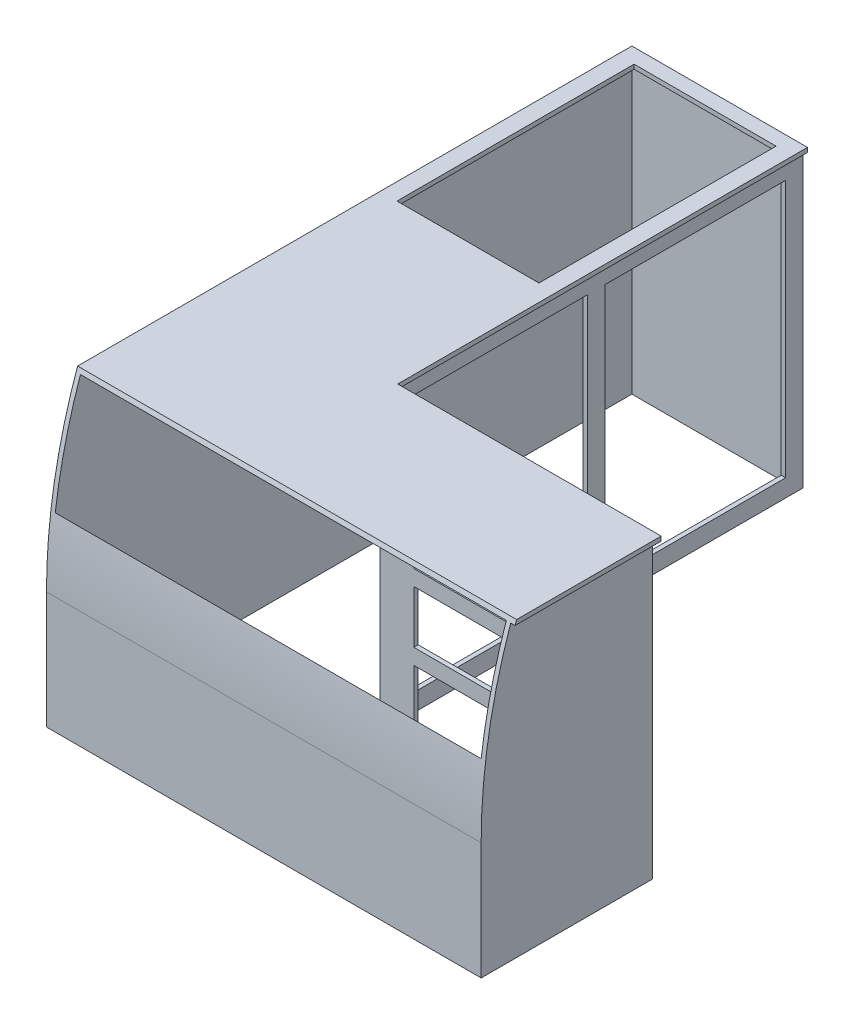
ISO-10303-21;
HEADER;
FILE_DESCRIPTION(('STEP AP214'),'2;1');
FILE_NAME('part.step','',(''),(''),'','','');
FILE_SCHEMA(('AUTOMOTIVE_DESIGN { 1 0 10303 214 1 1 1 1 }'));
ENDSEC;
DATA;
#1=APPLICATION_CONTEXT('core data for automotive mechanical design processes');
#2=APPLICATION_PROTOCOL_DEFINITION('international standard','automotive_design',2000,#1);
#3=PRODUCT_CONTEXT('',#1,'mechanical');
#4=PRODUCT('Part','Part','',(#3));
#5=PRODUCT_RELATED_PRODUCT_CATEGORY('part','',(#4));
#6=PRODUCT_DEFINITION_FORMATION('','',#4);
#7=PRODUCT_DEFINITION_CONTEXT('part definition',#1,'design');
#8=PRODUCT_DEFINITION('design','',#6,#7);
#9=PRODUCT_DEFINITION_SHAPE('','',#8);
#10=(LENGTH_UNIT() NAMED_UNIT(*) SI_UNIT(.MILLI.,.METRE.));
#11=(NAMED_UNIT(*) PLANE_ANGLE_UNIT() SI_UNIT($,.RADIAN.));
#12=(NAMED_UNIT(*) SI_UNIT($,.STERADIAN.) SOLID_ANGLE_UNIT());
#13=UNCERTAINTY_MEASURE_WITH_UNIT(LENGTH_MEASURE(1.E-05),#10,'distance_accuracy_value','');
#14=(GEOMETRIC_REPRESENTATION_CONTEXT(3) GLOBAL_UNCERTAINTY_ASSIGNED_CONTEXT((#13)) GLOBAL_UNIT_ASSIGNED_CONTEXT((#10,
#11,#12)) REPRESENTATION_CONTEXT('',''));
#15=CARTESIAN_POINT('',(0.,0.,0.));
#16=DIRECTION('',(0.,0.,1.));
#17=DIRECTION('',(1.,0.,0.));
#18=AXIS2_PLACEMENT_3D('',#15,#16,#17);
#19=CARTESIAN_POINT('',(-406.153119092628,-1015.,-766.568998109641));
#20=DIRECTION('',(0.,0.,1.));
#21=DIRECTION('',(1.,0.,0.));
#22=AXIS2_PLACEMENT_3D('',#19,#20,#21);
#23=PLANE('',#22);
#24=DIRECTION('',(0.,-1.,0.));
#25=VECTOR('',#24,1.);
#26=CARTESIAN_POINT('',(-306.153119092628,0.,-766.568998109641));
#27=LINE('',#26,#25);
#28=CARTESIAN_POINT('',(-306.153119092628,-541.7,-766.568998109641));
#29=VERTEX_POINT('',#28);
#30=CARTESIAN_POINT('',(-306.153119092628,-721.7,-766.568998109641));
#31=VERTEX_POINT('',#30);
#32=EDGE_CURVE('E405',#29,#31,#27,.T.);
#33=ORIENTED_EDGE('',*,*,#32,.T.);
#34=DIRECTION('',(-1.,0.,0.));
#35=VECTOR('',#34,1.);
#36=CARTESIAN_POINT('',(0.,-721.7,-766.568998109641));
#37=LINE('',#36,#35);
#38=CARTESIAN_POINT('',(393.846880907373,-721.7,-766.568998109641));
#39=VERTEX_POINT('',#38);
#40=EDGE_CURVE('E420',#39,#31,#37,.T.);
#41=ORIENTED_EDGE('',*,*,#40,.F.);
#42=DIRECTION('',(0.,-1.,0.));
#43=VECTOR('',#42,1.);
#44=CARTESIAN_POINT('',(393.846880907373,0.,-766.568998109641));
#45=LINE('',#44,#43);
#46=CARTESIAN_POINT('',(393.846880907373,-541.7,-766.568998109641));
#47=VERTEX_POINT('',#46);
#48=EDGE_CURVE('E417',#47,#39,#45,.T.);
#49=ORIENTED_EDGE('',*,*,#48,.F.);
#50=DIRECTION('',(-1.,0.,0.));
#51=VECTOR('',#50,1.);
#52=CARTESIAN_POINT('',(0.,-541.7,-766.568998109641));
#53=LINE('',#52,#51);
#54=EDGE_CURVE('E414',#47,#29,#53,.T.);
#55=ORIENTED_EDGE('',*,*,#54,.T.);
#56=EDGE_LOOP('',(#33,#41,#49,#55));
#57=FACE_BOUND('',#56,.T.);
#58=DIRECTION('',(0.,-1.,0.));
#59=VECTOR('',#58,1.);
#60=CARTESIAN_POINT('',(-306.153119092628,0.,-766.568998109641));
#61=LINE('',#60,#59);
#62=CARTESIAN_POINT('',(-306.153119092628,-75.,-766.568998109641));
#63=VERTEX_POINT('',#62);
#64=CARTESIAN_POINT('',(-306.153119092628,-255.,-766.568998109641));
#65=VERTEX_POINT('',#64);
#66=EDGE_CURVE('E447',#63,#65,#61,.T.);
#67=ORIENTED_EDGE('',*,*,#66,.T.);
#68=DIRECTION('',(-1.,0.,0.));
#69=VECTOR('',#68,1.);
#70=CARTESIAN_POINT('',(0.,-255.,-766.568998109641));
#71=LINE('',#70,#69);
#72=CARTESIAN_POINT('',(393.846880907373,-255.,-766.568998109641));
#73=VERTEX_POINT('',#72);
#74=EDGE_CURVE('E462',#73,#65,#71,.T.);
#75=ORIENTED_EDGE('',*,*,#74,.F.);
#76=DIRECTION('',(0.,-1.,0.));
#77=VECTOR('',#76,1.);
#78=CARTESIAN_POINT('',(393.846880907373,0.,-766.568998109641));
#79=LINE('',#78,#77);
#80=CARTESIAN_POINT('',(393.846880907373,-75.,-766.568998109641));
#81=VERTEX_POINT('',#80);
#82=EDGE_CURVE('E459',#81,#73,#79,.T.);
#83=ORIENTED_EDGE('',*,*,#82,.F.);
#84=DIRECTION('',(-1.,0.,0.));
#85=VECTOR('',#84,1.);
#86=CARTESIAN_POINT('',(0.,-75.,-766.568998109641));
#87=LINE('',#86,#85);
#88=EDGE_CURVE('E456',#81,#63,#87,.T.);
#89=ORIENTED_EDGE('',*,*,#88,.T.);
#90=EDGE_LOOP('',(#67,#75,#83,#89));
#91=FACE_BOUND('',#90,.T.);
#92=DIRECTION('',(1.,0.,0.));
#93=VECTOR('',#92,1.);
#94=CARTESIAN_POINT('',(-406.153119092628,-15.,-766.568998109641));
#95=LINE('',#94,#93);
#96=CARTESIAN_POINT('',(-406.153119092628,-15.,-766.568998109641));
#97=VERTEX_POINT('',#96);
#98=CARTESIAN_POINT('',(493.846880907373,-15.,-766.568998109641));
#99=VERTEX_POINT('',#98);
#100=EDGE_CURVE('E600',#97,#99,#95,.T.);
#101=ORIENTED_EDGE('',*,*,#100,.T.);
#102=DIRECTION('',(0.,1.,0.));
#103=VECTOR('',#102,1.);
#104=CARTESIAN_POINT('',(493.846880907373,-1015.,-766.568998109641));
#105=LINE('',#104,#103);
#106=CARTESIAN_POINT('',(493.846880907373,-1015.,-766.568998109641));
#107=VERTEX_POINT('',#106);
#108=EDGE_CURVE('E605',#107,#99,#105,.T.);
#109=ORIENTED_EDGE('',*,*,#108,.F.);
#110=DIRECTION('',(1.,0.,0.));
#111=VECTOR('',#110,1.);
#112=CARTESIAN_POINT('',(-406.153119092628,-1015.,-766.568998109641));
#113=LINE('',#112,#111);
#114=CARTESIAN_POINT('',(-406.153119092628,-1015.,-766.568998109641));
#115=VERTEX_POINT('',#114);
#116=EDGE_CURVE('E592',#115,#107,#113,.T.);
#117=ORIENTED_EDGE('',*,*,#116,.F.);
#118=DIRECTION('',(0.,1.,0.));
#119=VECTOR('',#118,1.);
#120=CARTESIAN_POINT('',(-406.153119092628,-1015.,-766.568998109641));
#121=LINE('',#120,#119);
#122=EDGE_CURVE('E800',#115,#97,#121,.T.);
#123=ORIENTED_EDGE('',*,*,#122,.T.);
#124=EDGE_LOOP('',(#101,#109,#117,#123));
#125=FACE_BOUND('',#124,.T.);
#126=DIRECTION('',(0.,-1.,0.));
#127=VECTOR('',#126,1.);
#128=CARTESIAN_POINT('',(-306.153119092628,0.,-766.568998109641));
#129=LINE('',#128,#127);
#130=CARTESIAN_POINT('',(-306.153119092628,-308.3,-766.568998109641));
#131=VERTEX_POINT('',#130);
#132=CARTESIAN_POINT('',(-306.153119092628,-488.3,-766.568998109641));
#133=VERTEX_POINT('',#132);
#134=EDGE_CURVE('E426',#131,#133,#129,.T.);
#135=ORIENTED_EDGE('',*,*,#134,.T.);
#136=DIRECTION('',(-1.,0.,0.));
#137=VECTOR('',#136,1.);
#138=CARTESIAN_POINT('',(0.,-488.3,-766.568998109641));
#139=LINE('',#138,#137);
#140=CARTESIAN_POINT('',(393.846880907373,-488.3,-766.568998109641));
#141=VERTEX_POINT('',#140);
#142=EDGE_CURVE('E441',#141,#133,#139,.T.);
#143=ORIENTED_EDGE('',*,*,#142,.F.);
#144=DIRECTION('',(0.,-1.,0.));
#145=VECTOR('',#144,1.);
#146=CARTESIAN_POINT('',(393.846880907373,0.,-766.568998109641));
#147=LINE('',#146,#145);
#148=CARTESIAN_POINT('',(393.846880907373,-308.3,-766.568998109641));
#149=VERTEX_POINT('',#148);
#150=EDGE_CURVE('E438',#149,#141,#147,.T.);
#151=ORIENTED_EDGE('',*,*,#150,.F.);
#152=DIRECTION('',(-1.,0.,0.));
#153=VECTOR('',#152,1.);
#154=CARTESIAN_POINT('',(0.,-308.3,-766.568998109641));
#155=LINE('',#154,#153);
#156=EDGE_CURVE('E435',#149,#131,#155,.T.);
#157=ORIENTED_EDGE('',*,*,#156,.T.);
#158=EDGE_LOOP('',(#135,#143,#151,#157));
#159=FACE_BOUND('',#158,.T.);
#160=DIRECTION('',(0.,-1.,0.));
#161=VECTOR('',#160,1.);
#162=CARTESIAN_POINT('',(-306.153119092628,0.,-766.568998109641));
#163=LINE('',#162,#161);
#164=CARTESIAN_POINT('',(-306.153119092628,-775.,-766.568998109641));
#165=VERTEX_POINT('',#164);
#166=CARTESIAN_POINT('',(-306.153119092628,-955.,-766.568998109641));
#167=VERTEX_POINT('',#166);
#168=EDGE_CURVE('E388',#165,#167,#163,.T.);
#169=ORIENTED_EDGE('',*,*,#168,.T.);
#170=DIRECTION('',(-1.,0.,0.));
#171=VECTOR('',#170,1.);
#172=CARTESIAN_POINT('',(0.,-955.,-766.568998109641));
#173=LINE('',#172,#171);
#174=CARTESIAN_POINT('',(393.846880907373,-955.,-766.568998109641));
#175=VERTEX_POINT('',#174);
#176=EDGE_CURVE('E399',#175,#167,#173,.T.);
#177=ORIENTED_EDGE('',*,*,#176,.F.);
#178=DIRECTION('',(0.,-1.,0.));
#179=VECTOR('',#178,1.);
#180=CARTESIAN_POINT('',(393.846880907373,0.,-766.568998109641));
#181=LINE('',#180,#179);
#182=CARTESIAN_POINT('',(393.846880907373,-775.,-766.568998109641));
#183=VERTEX_POINT('',#182);
#184=EDGE_CURVE('E396',#183,#175,#181,.T.);
#185=ORIENTED_EDGE('',*,*,#184,.F.);
#186=DIRECTION('',(-1.,0.,0.));
#187=VECTOR('',#186,1.);
#188=CARTESIAN_POINT('',(0.,-775.,-766.568998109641));
#189=LINE('',#188,#187);
#190=EDGE_CURVE('E393',#183,#165,#189,.T.);
#191=ORIENTED_EDGE('',*,*,#190,.T.);
#192=EDGE_LOOP('',(#169,#177,#185,#191));
#193=FACE_BOUND('',#192,.T.);
#194=ADVANCED_FACE('F69',(#57,#91,#125,#159,#193),#23,.F.);
#195=CARTESIAN_POINT('',(-421.153119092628,-1015.,-751.568998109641));
#196=DIRECTION('',(0.,0.,1.));
#197=DIRECTION('',(1.,0.,0.));
#198=AXIS2_PLACEMENT_3D('',#195,#196,#197);
#199=PLANE('',#198);
#200=DIRECTION('',(1.,0.,0.));
#201=VECTOR('',#200,1.);
#202=CARTESIAN_POINT('',(-421.153119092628,-15.,-751.568998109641));
#203=LINE('',#202,#201);
#204=CARTESIAN_POINT('',(-421.153119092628,-15.,-751.568998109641));
#205=VERTEX_POINT('',#204);
#206=CARTESIAN_POINT('',(478.846880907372,-15.,-751.568998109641));
#207=VERTEX_POINT('',#206);
#208=EDGE_CURVE('E558',#205,#207,#203,.T.);
#209=ORIENTED_EDGE('',*,*,#208,.F.);
#210=DIRECTION('',(0.,1.,0.));
#211=VECTOR('',#210,1.);
#212=CARTESIAN_POINT('',(-421.153119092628,-1015.,-751.568998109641));
#213=LINE('',#212,#211);
#214=CARTESIAN_POINT('',(-421.153119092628,-1015.,-751.568998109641));
#215=VERTEX_POINT('',#214);
#216=EDGE_CURVE('E580',#215,#205,#213,.T.);
#217=ORIENTED_EDGE('',*,*,#216,.F.);
#218=DIRECTION('',(1.,0.,0.));
#219=VECTOR('',#218,1.);
#220=CARTESIAN_POINT('',(-421.153119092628,-1015.,-751.568998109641));
#221=LINE('',#220,#219);
#222=CARTESIAN_POINT('',(478.846880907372,-1015.,-751.568998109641));
#223=VERTEX_POINT('',#222);
#224=EDGE_CURVE('E543',#215,#223,#221,.T.);
#225=ORIENTED_EDGE('',*,*,#224,.T.);
#226=DIRECTION('',(0.,1.,0.));
#227=VECTOR('',#226,1.);
#228=CARTESIAN_POINT('',(478.846880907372,-1015.,-751.568998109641));
#229=LINE('',#228,#227);
#230=EDGE_CURVE('E578',#223,#207,#229,.T.);
#231=ORIENTED_EDGE('',*,*,#230,.T.);
#232=EDGE_LOOP('',(#209,#217,#225,#231));
#233=FACE_BOUND('',#232,.T.);
#234=DIRECTION('',(1.,0.,0.));
#235=VECTOR('',#234,1.);
#236=CARTESIAN_POINT('',(-421.153119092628,-255.,-751.568998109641));
#237=LINE('',#236,#235);
#238=CARTESIAN_POINT('',(-306.153119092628,-255.,-751.568998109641));
#239=VERTEX_POINT('',#238);
#240=CARTESIAN_POINT('',(393.846880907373,-255.,-751.568998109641));
#241=VERTEX_POINT('',#240);
#242=EDGE_CURVE('E645',#239,#241,#237,.T.);
#243=ORIENTED_EDGE('',*,*,#242,.F.);
#244=DIRECTION('',(0.,1.,0.));
#245=VECTOR('',#244,1.);
#246=CARTESIAN_POINT('',(-306.153119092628,-1015.,-751.568998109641));
#247=LINE('',#246,#245);
#248=CARTESIAN_POINT('',(-306.153119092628,-75.,-751.568998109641));
#249=VERTEX_POINT('',#248);
#250=EDGE_CURVE('E647',#239,#249,#247,.T.);
#251=ORIENTED_EDGE('',*,*,#250,.T.);
#252=DIRECTION('',(1.,0.,0.));
#253=VECTOR('',#252,1.);
#254=CARTESIAN_POINT('',(-421.153119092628,-75.,-751.568998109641));
#255=LINE('',#254,#253);
#256=CARTESIAN_POINT('',(393.846880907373,-75.,-751.568998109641));
#257=VERTEX_POINT('',#256);
#258=EDGE_CURVE('E639',#249,#257,#255,.T.);
#259=ORIENTED_EDGE('',*,*,#258,.T.);
#260=DIRECTION('',(0.,1.,0.));
#261=VECTOR('',#260,1.);
#262=CARTESIAN_POINT('',(393.846880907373,-1015.,-751.568998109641));
#263=LINE('',#262,#261);
#264=EDGE_CURVE('E642',#241,#257,#263,.T.);
#265=ORIENTED_EDGE('',*,*,#264,.F.);
#266=EDGE_LOOP('',(#243,#251,#259,#265));
#267=FACE_BOUND('',#266,.T.);
#268=DIRECTION('',(1.,0.,0.));
#269=VECTOR('',#268,1.);
#270=CARTESIAN_POINT('',(-421.153119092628,-488.3,-751.568998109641));
#271=LINE('',#270,#269);
#272=CARTESIAN_POINT('',(-306.153119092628,-488.3,-751.568998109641));
#273=VERTEX_POINT('',#272);
#274=CARTESIAN_POINT('',(393.846880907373,-488.3,-751.568998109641));
#275=VERTEX_POINT('',#274);
#276=EDGE_CURVE('E656',#273,#275,#271,.T.);
#277=ORIENTED_EDGE('',*,*,#276,.F.);
#278=DIRECTION('',(0.,1.,0.));
#279=VECTOR('',#278,1.);
#280=CARTESIAN_POINT('',(-306.153119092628,-1015.,-751.568998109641));
#281=LINE('',#280,#279);
#282=CARTESIAN_POINT('',(-306.153119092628,-308.3,-751.568998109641));
#283=VERTEX_POINT('',#282);
#284=EDGE_CURVE('E658',#273,#283,#281,.T.);
#285=ORIENTED_EDGE('',*,*,#284,.T.);
#286=DIRECTION('',(1.,0.,0.));
#287=VECTOR('',#286,1.);
#288=CARTESIAN_POINT('',(-421.153119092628,-308.3,-751.568998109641));
#289=LINE('',#288,#287);
#290=CARTESIAN_POINT('',(393.846880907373,-308.3,-751.568998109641));
#291=VERTEX_POINT('',#290);
#292=EDGE_CURVE('E650',#283,#291,#289,.T.);
#293=ORIENTED_EDGE('',*,*,#292,.T.);
#294=DIRECTION('',(0.,1.,0.));
#295=VECTOR('',#294,1.);
#296=CARTESIAN_POINT('',(393.846880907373,-1015.,-751.568998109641));
#297=LINE('',#296,#295);
#298=EDGE_CURVE('E653',#275,#291,#297,.T.);
#299=ORIENTED_EDGE('',*,*,#298,.F.);
#300=EDGE_LOOP('',(#277,#285,#293,#299));
#301=FACE_BOUND('',#300,.T.);
#302=DIRECTION('',(1.,0.,0.));
#303=VECTOR('',#302,1.);
#304=CARTESIAN_POINT('',(-421.153119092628,-721.7,-751.568998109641));
#305=LINE('',#304,#303);
#306=CARTESIAN_POINT('',(-306.153119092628,-721.7,-751.568998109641));
#307=VERTEX_POINT('',#306);
#308=CARTESIAN_POINT('',(393.846880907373,-721.7,-751.568998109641));
#309=VERTEX_POINT('',#308);
#310=EDGE_CURVE('E667',#307,#309,#305,.T.);
#311=ORIENTED_EDGE('',*,*,#310,.F.);
#312=DIRECTION('',(0.,1.,0.));
#313=VECTOR('',#312,1.);
#314=CARTESIAN_POINT('',(-306.153119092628,-1015.,-751.568998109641));
#315=LINE('',#314,#313);
#316=CARTESIAN_POINT('',(-306.153119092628,-541.7,-751.568998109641));
#317=VERTEX_POINT('',#316);
#318=EDGE_CURVE('E669',#307,#317,#315,.T.);
#319=ORIENTED_EDGE('',*,*,#318,.T.);
#320=DIRECTION('',(1.,0.,0.));
#321=VECTOR('',#320,1.);
#322=CARTESIAN_POINT('',(-421.153119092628,-541.7,-751.568998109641));
#323=LINE('',#322,#321);
#324=CARTESIAN_POINT('',(393.846880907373,-541.7,-751.568998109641));
#325=VERTEX_POINT('',#324);
#326=EDGE_CURVE('E661',#317,#325,#323,.T.);
#327=ORIENTED_EDGE('',*,*,#326,.T.);
#328=DIRECTION('',(0.,1.,0.));
#329=VECTOR('',#328,1.);
#330=CARTESIAN_POINT('',(393.846880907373,-1015.,-751.568998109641));
#331=LINE('',#330,#329);
#332=EDGE_CURVE('E664',#309,#325,#331,.T.);
#333=ORIENTED_EDGE('',*,*,#332,.F.);
#334=EDGE_LOOP('',(#311,#319,#327,#333));
#335=FACE_BOUND('',#334,.T.);
#336=DIRECTION('',(1.,0.,0.));
#337=VECTOR('',#336,1.);
#338=CARTESIAN_POINT('',(-421.153119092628,-955.,-751.568998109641));
#339=LINE('',#338,#337);
#340=CARTESIAN_POINT('',(-306.153119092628,-955.,-751.568998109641));
#341=VERTEX_POINT('',#340);
#342=CARTESIAN_POINT('',(393.846880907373,-955.,-751.568998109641));
#343=VERTEX_POINT('',#342);
#344=EDGE_CURVE('E678',#341,#343,#339,.T.);
#345=ORIENTED_EDGE('',*,*,#344,.F.);
#346=DIRECTION('',(0.,1.,0.));
#347=VECTOR('',#346,1.);
#348=CARTESIAN_POINT('',(-306.153119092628,-1015.,-751.568998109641));
#349=LINE('',#348,#347);
#350=CARTESIAN_POINT('',(-306.153119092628,-775.,-751.568998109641));
#351=VERTEX_POINT('',#350);
#352=EDGE_CURVE('E680',#341,#351,#349,.T.);
#353=ORIENTED_EDGE('',*,*,#352,.T.);
#354=DIRECTION('',(1.,0.,0.));
#355=VECTOR('',#354,1.);
#356=CARTESIAN_POINT('',(-421.153119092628,-775.,-751.568998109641));
#357=LINE('',#356,#355);
#358=CARTESIAN_POINT('',(393.846880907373,-775.,-751.568998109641));
#359=VERTEX_POINT('',#358);
#360=EDGE_CURVE('E672',#351,#359,#357,.T.);
#361=ORIENTED_EDGE('',*,*,#360,.T.);
#362=DIRECTION('',(0.,1.,0.));
#363=VECTOR('',#362,1.);
#364=CARTESIAN_POINT('',(393.846880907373,-1015.,-751.568998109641));
#365=LINE('',#364,#363);
#366=EDGE_CURVE('E675',#343,#359,#365,.T.);
#367=ORIENTED_EDGE('',*,*,#366,.F.);
#368=EDGE_LOOP('',(#345,#353,#361,#367));
#369=FACE_BOUND('',#368,.T.);
#370=ADVANCED_FACE('F707',(#233,#267,#301,#335,#369),#199,.T.);
#371=CARTESIAN_POINT('',(0.,-15.,0.));
#372=DIRECTION('',(0.,1.,0.));
#373=DIRECTION('',(0.,0.,1.));
#374=AXIS2_PLACEMENT_3D('',#371,#372,#373);
#375=PLANE('',#374);
#376=DIRECTION('',(-1.,0.,0.));
#377=VECTOR('',#376,1.);
#378=CARTESIAN_POINT('',(543.846880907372,-15.,-282.548104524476));
#379=LINE('',#378,#377);
#380=CARTESIAN_POINT('',(493.846880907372,-15.,-282.548104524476));
#381=VERTEX_POINT('',#380);
#382=CARTESIAN_POINT('',(508.846880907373,-15.,-282.548104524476));
#383=VERTEX_POINT('',#382);
#384=EDGE_CURVE('E494',#381,#383,#379,.F.);
#385=ORIENTED_EDGE('',*,*,#384,.F.);
#386=DIRECTION('',(0.,0.,1.));
#387=VECTOR('',#386,1.);
#388=CARTESIAN_POINT('',(493.846880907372,-15.,-181.568998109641));
#389=LINE('',#388,#387);
#390=EDGE_CURVE('E588',#99,#381,#389,.T.);
#391=ORIENTED_EDGE('',*,*,#390,.F.);
#392=ORIENTED_EDGE('',*,*,#100,.F.);
#393=DIRECTION('',(0.,0.,1.));
#394=VECTOR('',#393,1.);
#395=CARTESIAN_POINT('',(-406.153119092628,-15.,-2181.56899810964));
#396=LINE('',#395,#394);
#397=CARTESIAN_POINT('',(-406.153119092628,-15.,-2181.56899810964));
#398=VERTEX_POINT('',#397);
#399=EDGE_CURVE('E583',#398,#97,#396,.T.);
#400=ORIENTED_EDGE('',*,*,#399,.F.);
#401=DIRECTION('',(-1.,0.,0.));
#402=VECTOR('',#401,1.);
#403=CARTESIAN_POINT('',(-991.153119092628,-15.,-2181.56899810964));
#404=LINE('',#403,#402);
#405=CARTESIAN_POINT('',(-391.153119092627,-15.,-2181.56899810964));
#406=VERTEX_POINT('',#405);
#407=EDGE_CURVE('E789',#406,#398,#404,.T.);
#408=ORIENTED_EDGE('',*,*,#407,.F.);
#409=DIRECTION('',(0.,0.,-1.));
#410=VECTOR('',#409,1.);
#411=CARTESIAN_POINT('',(-391.153119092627,-15.,-781.568998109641));
#412=LINE('',#411,#410);
#413=CARTESIAN_POINT('',(-391.153119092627,-15.,-781.568998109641));
#414=VERTEX_POINT('',#413);
#415=EDGE_CURVE('E792',#414,#406,#412,.T.);
#416=ORIENTED_EDGE('',*,*,#415,.F.);
#417=DIRECTION('',(-1.,0.,0.));
#418=VECTOR('',#417,1.);
#419=CARTESIAN_POINT('',(-391.153119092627,-15.,-781.568998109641));
#420=LINE('',#419,#418);
#421=CARTESIAN_POINT('',(508.846880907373,-15.,-781.568998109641));
#422=VERTEX_POINT('',#421);
#423=EDGE_CURVE('E798',#422,#414,#420,.T.);
#424=ORIENTED_EDGE('',*,*,#423,.F.);
#425=DIRECTION('',(0.,0.,-1.));
#426=VECTOR('',#425,1.);
#427=CARTESIAN_POINT('',(508.846880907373,-15.,-781.568998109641));
#428=LINE('',#427,#426);
#429=EDGE_CURVE('E780',#383,#422,#428,.T.);
#430=ORIENTED_EDGE('',*,*,#429,.F.);
#431=EDGE_LOOP('',(#385,#391,#392,#400,#408,#416,#424,#430));
#432=FACE_BOUND('',#431,.T.);
#433=ADVANCED_FACE('F713',(#432),#375,.F.);
#434=CARTESIAN_POINT('',(508.846880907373,-15.,-781.568998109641));
#435=DIRECTION('',(1.,0.,0.));
#436=DIRECTION('',(0.,0.,-1.));
#437=AXIS2_PLACEMENT_3D('',#434,#435,#436);
#438=PLANE('',#437);
#439=DIRECTION('',(0.,0.,-1.));
#440=VECTOR('',#439,1.);
#441=CARTESIAN_POINT('',(508.846880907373,0.,-781.568998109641));
#442=LINE('',#441,#440);
#443=CARTESIAN_POINT('',(508.846880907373,-1.11022302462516E-13,-287.817203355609));
#444=VERTEX_POINT('',#443);
#445=CARTESIAN_POINT('',(508.846880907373,0.,-781.568998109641));
#446=VERTEX_POINT('',#445);
#447=EDGE_CURVE('E767',#444,#446,#442,.T.);
#448=ORIENTED_EDGE('',*,*,#447,.F.);
#449=CARTESIAN_POINT('',(508.846880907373,-615.,-2014.60551960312));
#450=DIRECTION('',(1.,0.,0.));
#451=DIRECTION('',(0.,0.,-1.));
#452=AXIS2_PLACEMENT_3D('',#449,#450,#451);
#453=CIRCLE('',#452,1833.03652149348);
#454=EDGE_CURVE('E496',#444,#383,#453,.T.);
#455=ORIENTED_EDGE('',*,*,#454,.T.);
#456=ORIENTED_EDGE('',*,*,#429,.T.);
#457=DIRECTION('',(0.,1.,0.));
#458=VECTOR('',#457,1.);
#459=CARTESIAN_POINT('',(508.846880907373,-15.,-781.568998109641));
#460=LINE('',#459,#458);
#461=EDGE_CURVE('E761',#422,#446,#460,.T.);
#462=ORIENTED_EDGE('',*,*,#461,.T.);
#463=EDGE_LOOP('',(#448,#455,#456,#462));
#464=FACE_BOUND('',#463,.T.);
#465=ADVANCED_FACE('F71',(#464),#438,.T.);
#466=CARTESIAN_POINT('',(-991.153119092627,-15.,-181.568998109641));
#467=DIRECTION('',(0.,0.,1.));
#468=DIRECTION('',(1.,0.,0.));
#469=AXIS2_PLACEMENT_3D('',#466,#467,#468);
#470=PLANE('',#469);
#471=DIRECTION('',(0.,1.,0.));
#472=VECTOR('',#471,1.);
#473=CARTESIAN_POINT('',(493.846880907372,-1015.,-181.568998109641));
#474=LINE('',#473,#472);
#475=CARTESIAN_POINT('',(493.846880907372,-1015.,-181.568998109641));
#476=VERTEX_POINT('',#475);
#477=CARTESIAN_POINT('',(493.846880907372,-615.,-181.568998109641));
#478=VERTEX_POINT('',#477);
#479=EDGE_CURVE('E599',#476,#478,#474,.T.);
#480=ORIENTED_EDGE('',*,*,#479,.T.);
#481=DIRECTION('',(-1.,0.,0.));
#482=VECTOR('',#481,1.);
#483=CARTESIAN_POINT('',(543.846880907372,-615.,-181.568998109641));
#484=LINE('',#483,#482);
#485=CARTESIAN_POINT('',(-991.153119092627,-615.,-181.568998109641));
#486=VERTEX_POINT('',#485);
#487=EDGE_CURVE('E480',#478,#486,#484,.T.);
#488=ORIENTED_EDGE('',*,*,#487,.T.);
#489=DIRECTION('',(0.,1.,0.));
#490=VECTOR('',#489,1.);
#491=CARTESIAN_POINT('',(-991.153119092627,-15.,-181.568998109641));
#492=LINE('',#491,#490);
#493=CARTESIAN_POINT('',(-991.153119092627,-1015.,-181.568998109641));
#494=VERTEX_POINT('',#493);
#495=EDGE_CURVE('E620',#494,#486,#492,.T.);
#496=ORIENTED_EDGE('',*,*,#495,.F.);
#497=DIRECTION('',(-1.,0.,0.));
#498=VECTOR('',#497,1.);
#499=CARTESIAN_POINT('',(-991.153119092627,-1015.,-181.568998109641));
#500=LINE('',#499,#498);
#501=EDGE_CURVE('E596',#476,#494,#500,.T.);
#502=ORIENTED_EDGE('',*,*,#501,.F.);
#503=EDGE_LOOP('',(#480,#488,#496,#502));
#504=FACE_BOUND('',#503,.T.);
#505=ADVANCED_FACE('F732',(#504),#470,.T.);
#506=CARTESIAN_POINT('',(-991.153119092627,-15.,-181.568998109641));
#507=DIRECTION('',(-1.,0.,0.));
#508=DIRECTION('',(0.,0.,1.));
#509=AXIS2_PLACEMENT_3D('',#506,#507,#508);
#510=PLANE('',#509);
#511=ORIENTED_EDGE('',*,*,#495,.T.);
#512=CARTESIAN_POINT('',(-991.153119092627,-615.,-2014.60551960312));
#513=DIRECTION('',(1.,0.,0.));
#514=DIRECTION('',(0.,0.,-1.));
#515=AXIS2_PLACEMENT_3D('',#512,#513,#514);
#516=CIRCLE('',#515,1833.03652149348);
#517=CARTESIAN_POINT('',(-991.153119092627,-1.11022302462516E-13,-287.817203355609));
#518=VERTEX_POINT('',#517);
#519=EDGE_CURVE('E477',#486,#518,#516,.F.);
#520=ORIENTED_EDGE('',*,*,#519,.T.);
#521=DIRECTION('',(0.,0.,1.));
#522=VECTOR('',#521,1.);
#523=CARTESIAN_POINT('',(-991.153119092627,0.,-181.568998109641));
#524=LINE('',#523,#522);
#525=CARTESIAN_POINT('',(-991.153119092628,0.,-2181.56899810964));
#526=VERTEX_POINT('',#525);
#527=EDGE_CURVE('E777',#526,#518,#524,.T.);
#528=ORIENTED_EDGE('',*,*,#527,.F.);
#529=DIRECTION('',(0.,1.,0.));
#530=VECTOR('',#529,1.);
#531=CARTESIAN_POINT('',(-991.153119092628,-15.,-2181.56899810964));
#532=LINE('',#531,#530);
#533=CARTESIAN_POINT('',(-991.153119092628,-1015.,-2181.56899810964));
#534=VERTEX_POINT('',#533);
#535=EDGE_CURVE('E783',#534,#526,#532,.T.);
#536=ORIENTED_EDGE('',*,*,#535,.F.);
#537=DIRECTION('',(0.,0.,-1.));
#538=VECTOR('',#537,1.);
#539=CARTESIAN_POINT('',(-991.153119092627,-1015.,-181.568998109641));
#540=LINE('',#539,#538);
#541=EDGE_CURVE('E584',#494,#534,#540,.T.);
#542=ORIENTED_EDGE('',*,*,#541,.F.);
#543=EDGE_LOOP('',(#511,#520,#528,#536,#542));
#544=FACE_BOUND('',#543,.T.);
#545=ADVANCED_FACE('F731',(#544),#510,.T.);
#546=CARTESIAN_POINT('',(0.,0.,0.));
#547=DIRECTION('',(0.,1.,0.));
#548=DIRECTION('',(0.,0.,1.));
#549=AXIS2_PLACEMENT_3D('',#546,#547,#548);
#550=PLANE('',#549);
#551=DIRECTION('',(0.,0.,1.));
#552=VECTOR('',#551,1.);
#553=CARTESIAN_POINT('',(-933.653119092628,0.,-1321.56899810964));
#554=LINE('',#553,#552);
#555=CARTESIAN_POINT('',(-933.653119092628,0.,-2131.56899810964));
#556=VERTEX_POINT('',#555);
#557=CARTESIAN_POINT('',(-933.653119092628,0.,-1321.56899810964));
#558=VERTEX_POINT('',#557);
#559=EDGE_CURVE('E84',#556,#558,#554,.T.);
#560=ORIENTED_EDGE('',*,*,#559,.F.);
#561=DIRECTION('',(-1.,0.,0.));
#562=VECTOR('',#561,1.);
#563=CARTESIAN_POINT('',(-933.653119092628,0.,-2131.56899810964));
#564=LINE('',#563,#562);
#565=CARTESIAN_POINT('',(-448.653119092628,0.,-2131.56899810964));
#566=VERTEX_POINT('',#565);
#567=EDGE_CURVE('E381',#566,#556,#564,.T.);
#568=ORIENTED_EDGE('',*,*,#567,.F.);
#569=DIRECTION('',(0.,0.,-1.));
#570=VECTOR('',#569,1.);
#571=CARTESIAN_POINT('',(-448.653119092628,0.,-1321.56899810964));
#572=LINE('',#571,#570);
#573=CARTESIAN_POINT('',(-448.653119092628,0.,-1321.56899810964));
#574=VERTEX_POINT('',#573);
#575=EDGE_CURVE('E365',#574,#566,#572,.T.);
#576=ORIENTED_EDGE('',*,*,#575,.F.);
#577=DIRECTION('',(1.,0.,0.));
#578=VECTOR('',#577,1.);
#579=CARTESIAN_POINT('',(-933.653119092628,0.,-1321.56899810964));
#580=LINE('',#579,#578);
#581=EDGE_CURVE('E374',#558,#574,#580,.T.);
#582=ORIENTED_EDGE('',*,*,#581,.F.);
#583=EDGE_LOOP('',(#560,#568,#576,#582));
#584=FACE_BOUND('',#583,.T.);
#585=ORIENTED_EDGE('',*,*,#527,.T.);
#586=DIRECTION('',(1.,0.,0.));
#587=VECTOR('',#586,1.);
#588=CARTESIAN_POINT('',(-991.153119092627,-1.11022302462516E-13,-287.817203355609));
#589=LINE('',#588,#587);
#590=EDGE_CURVE('E468',#518,#444,#589,.T.);
#591=ORIENTED_EDGE('',*,*,#590,.T.);
#592=ORIENTED_EDGE('',*,*,#447,.T.);
#593=DIRECTION('',(-1.,0.,0.));
#594=VECTOR('',#593,1.);
#595=CARTESIAN_POINT('',(-391.153119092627,0.,-781.568998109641));
#596=LINE('',#595,#594);
#597=CARTESIAN_POINT('',(-391.153119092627,0.,-781.568998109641));
#598=VERTEX_POINT('',#597);
#599=EDGE_CURVE('E758',#446,#598,#596,.T.);
#600=ORIENTED_EDGE('',*,*,#599,.T.);
#601=DIRECTION('',(0.,0.,-1.));
#602=VECTOR('',#601,1.);
#603=CARTESIAN_POINT('',(-391.153119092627,0.,-781.568998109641));
#604=LINE('',#603,#602);
#605=CARTESIAN_POINT('',(-391.153119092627,0.,-2181.56899810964));
#606=VERTEX_POINT('',#605);
#607=EDGE_CURVE('E766',#598,#606,#604,.T.);
#608=ORIENTED_EDGE('',*,*,#607,.T.);
#609=DIRECTION('',(-1.,0.,0.));
#610=VECTOR('',#609,1.);
#611=CARTESIAN_POINT('',(-991.153119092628,0.,-2181.56899810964));
#612=LINE('',#611,#610);
#613=EDGE_CURVE('E769',#606,#526,#612,.T.);
#614=ORIENTED_EDGE('',*,*,#613,.T.);
#615=EDGE_LOOP('',(#585,#591,#592,#600,#608,#614));
#616=FACE_BOUND('',#615,.T.);
#617=ADVANCED_FACE('F378',(#584,#616),#550,.T.);
#618=CARTESIAN_POINT('',(493.846880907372,-1015.,-181.568998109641));
#619=DIRECTION('',(-1.,0.,0.));
#620=DIRECTION('',(0.,0.,1.));
#621=AXIS2_PLACEMENT_3D('',#618,#619,#620);
#622=PLANE('',#621);
#623=CARTESIAN_POINT('',(493.846880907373,-615.,-2014.60551960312));
#624=DIRECTION('',(-1.,0.,0.));
#625=DIRECTION('',(0.,0.,1.));
#626=AXIS2_PLACEMENT_3D('',#623,#624,#625);
#627=CIRCLE('',#626,1833.03652149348);
#628=EDGE_CURVE('E492',#478,#381,#627,.T.);
#629=ORIENTED_EDGE('',*,*,#628,.F.);
#630=ORIENTED_EDGE('',*,*,#479,.F.);
#631=DIRECTION('',(0.,0.,1.));
#632=VECTOR('',#631,1.);
#633=CARTESIAN_POINT('',(493.846880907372,-1015.,-181.568998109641));
#634=LINE('',#633,#632);
#635=EDGE_CURVE('E594',#107,#476,#634,.T.);
#636=ORIENTED_EDGE('',*,*,#635,.F.);
#637=ORIENTED_EDGE('',*,*,#108,.T.);
#638=ORIENTED_EDGE('',*,*,#390,.T.);
#639=EDGE_LOOP('',(#629,#630,#636,#637,#638));
#640=FACE_BOUND('',#639,.T.);
#641=ADVANCED_FACE('F719',(#640),#622,.F.);
#642=CARTESIAN_POINT('',(478.846880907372,-1015.,-196.568998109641));
#643=DIRECTION('',(-1.,0.,0.));
#644=DIRECTION('',(0.,0.,1.));
#645=AXIS2_PLACEMENT_3D('',#642,#643,#644);
#646=PLANE('',#645);
#647=DIRECTION('',(0.,1.,0.));
#648=VECTOR('',#647,1.);
#649=CARTESIAN_POINT('',(478.846880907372,-1015.,-196.568998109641));
#650=LINE('',#649,#648);
#651=CARTESIAN_POINT('',(478.846880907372,-1015.,-196.568998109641));
#652=VERTEX_POINT('',#651);
#653=CARTESIAN_POINT('',(478.846880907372,-380.97842910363,-196.568998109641));
#654=VERTEX_POINT('',#653);
#655=EDGE_CURVE('E575',#652,#654,#650,.T.);
#656=ORIENTED_EDGE('',*,*,#655,.T.);
#657=CARTESIAN_POINT('',(478.846880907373,-615.,-2014.60551960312));
#658=DIRECTION('',(-1.,0.,0.));
#659=DIRECTION('',(0.,0.,1.));
#660=AXIS2_PLACEMENT_3D('',#657,#658,#659);
#661=CIRCLE('',#660,1833.03652149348);
#662=CARTESIAN_POINT('',(478.846880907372,-15.,-282.548104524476));
#663=VERTEX_POINT('',#662);
#664=EDGE_CURVE('E489',#654,#663,#661,.T.);
#665=ORIENTED_EDGE('',*,*,#664,.T.);
#666=DIRECTION('',(0.,0.,1.));
#667=VECTOR('',#666,1.);
#668=CARTESIAN_POINT('',(478.846880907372,-15.,-196.568998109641));
#669=LINE('',#668,#667);
#670=EDGE_CURVE('E561',#207,#663,#669,.T.);
#671=ORIENTED_EDGE('',*,*,#670,.F.);
#672=ORIENTED_EDGE('',*,*,#230,.F.);
#673=DIRECTION('',(0.,0.,1.));
#674=VECTOR('',#673,1.);
#675=CARTESIAN_POINT('',(478.846880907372,-1015.,-196.568998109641));
#676=LINE('',#675,#674);
#677=EDGE_CURVE('E546',#223,#652,#676,.T.);
#678=ORIENTED_EDGE('',*,*,#677,.T.);
#679=EDGE_LOOP('',(#656,#665,#671,#672,#678));
#680=FACE_BOUND('',#679,.T.);
#681=ADVANCED_FACE('F856',(#680),#646,.T.);
#682=CARTESIAN_POINT('',(-976.153119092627,-1015.,-196.568998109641));
#683=DIRECTION('',(0.,0.,-1.));
#684=DIRECTION('',(-1.,0.,0.));
#685=AXIS2_PLACEMENT_3D('',#682,#683,#684);
#686=PLANE('',#685);
#687=DIRECTION('',(0.,1.,0.));
#688=VECTOR('',#687,1.);
#689=CARTESIAN_POINT('',(-976.153119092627,-1015.,-196.568998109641));
#690=LINE('',#689,#688);
#691=CARTESIAN_POINT('',(-976.153119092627,-1015.,-196.568998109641));
#692=VERTEX_POINT('',#691);
#693=CARTESIAN_POINT('',(-976.153119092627,-380.978429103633,-196.568998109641));
#694=VERTEX_POINT('',#693);
#695=EDGE_CURVE('E572',#692,#694,#690,.T.);
#696=ORIENTED_EDGE('',*,*,#695,.T.);
#697=DIRECTION('',(-1.,0.,0.));
#698=VECTOR('',#697,1.);
#699=CARTESIAN_POINT('',(543.846880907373,-380.97842910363,-196.568998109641));
#700=LINE('',#699,#698);
#701=EDGE_CURVE('E486',#694,#654,#700,.F.);
#702=ORIENTED_EDGE('',*,*,#701,.T.);
#703=ORIENTED_EDGE('',*,*,#655,.F.);
#704=DIRECTION('',(-1.,0.,0.));
#705=VECTOR('',#704,1.);
#706=CARTESIAN_POINT('',(-976.153119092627,-1015.,-196.568998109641));
#707=LINE('',#706,#705);
#708=EDGE_CURVE('E548',#652,#692,#707,.T.);
#709=ORIENTED_EDGE('',*,*,#708,.T.);
#710=EDGE_LOOP('',(#696,#702,#703,#709));
#711=FACE_BOUND('',#710,.T.);
#712=ADVANCED_FACE('F862',(#711),#686,.T.);
#713=CARTESIAN_POINT('',(-976.153119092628,-1015.,-2166.56899810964));
#714=DIRECTION('',(1.,0.,0.));
#715=DIRECTION('',(0.,0.,-1.));
#716=AXIS2_PLACEMENT_3D('',#713,#714,#715);
#717=PLANE('',#716);
#718=DIRECTION('',(0.,0.,-1.));
#719=VECTOR('',#718,1.);
#720=CARTESIAN_POINT('',(-976.153119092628,-15.,-2166.56899810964));
#721=LINE('',#720,#719);
#722=CARTESIAN_POINT('',(-976.153119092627,-15.,-282.548104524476));
#723=VERTEX_POINT('',#722);
#724=CARTESIAN_POINT('',(-976.153119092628,-15.,-2166.56899810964));
#725=VERTEX_POINT('',#724);
#726=EDGE_CURVE('E564',#723,#725,#721,.T.);
#727=ORIENTED_EDGE('',*,*,#726,.F.);
#728=CARTESIAN_POINT('',(-976.153119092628,-615.,-2014.60551960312));
#729=DIRECTION('',(1.,0.,0.));
#730=DIRECTION('',(0.,0.,-1.));
#731=AXIS2_PLACEMENT_3D('',#728,#729,#730);
#732=CIRCLE('',#731,1833.03652149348);
#733=EDGE_CURVE('E483',#723,#694,#732,.T.);
#734=ORIENTED_EDGE('',*,*,#733,.T.);
#735=ORIENTED_EDGE('',*,*,#695,.F.);
#736=DIRECTION('',(0.,0.,-1.));
#737=VECTOR('',#736,1.);
#738=CARTESIAN_POINT('',(-976.153119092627,-1015.,-196.568998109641));
#739=LINE('',#738,#737);
#740=CARTESIAN_POINT('',(-976.153119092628,-1015.,-2166.56899810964));
#741=VERTEX_POINT('',#740);
#742=EDGE_CURVE('E550',#692,#741,#739,.T.);
#743=ORIENTED_EDGE('',*,*,#742,.T.);
#744=DIRECTION('',(0.,1.,0.));
#745=VECTOR('',#744,1.);
#746=CARTESIAN_POINT('',(-976.153119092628,-1015.,-2166.56899810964));
#747=LINE('',#746,#745);
#748=EDGE_CURVE('E569',#741,#725,#747,.T.);
#749=ORIENTED_EDGE('',*,*,#748,.T.);
#750=EDGE_LOOP('',(#727,#734,#735,#743,#749));
#751=FACE_BOUND('',#750,.T.);
#752=ADVANCED_FACE('F870',(#751),#717,.T.);
#753=DIRECTION('',(-1.,0.,0.));
#754=VECTOR('',#753,1.);
#755=CARTESIAN_POINT('',(0.,-15.,-2131.56899810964));
#756=LINE('',#755,#754);
#757=CARTESIAN_POINT('',(-448.653119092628,-15.,-2131.56899810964));
#758=VERTEX_POINT('',#757);
#759=CARTESIAN_POINT('',(-933.653119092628,-15.,-2131.56899810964));
#760=VERTEX_POINT('',#759);
#761=EDGE_CURVE('E77',#758,#760,#756,.T.);
#762=ORIENTED_EDGE('',*,*,#761,.T.);
#763=DIRECTION('',(0.,0.,1.));
#764=VECTOR('',#763,1.);
#765=CARTESIAN_POINT('',(-933.653119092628,-15.,0.));
#766=LINE('',#765,#764);
#767=CARTESIAN_POINT('',(-933.653119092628,-15.,-1321.56899810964));
#768=VERTEX_POINT('',#767);
#769=EDGE_CURVE('E12',#760,#768,#766,.T.);
#770=ORIENTED_EDGE('',*,*,#769,.T.);
#771=DIRECTION('',(1.,0.,0.));
#772=VECTOR('',#771,1.);
#773=CARTESIAN_POINT('',(0.,-15.,-1321.56899810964));
#774=LINE('',#773,#772);
#775=CARTESIAN_POINT('',(-448.653119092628,-15.,-1321.56899810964));
#776=VERTEX_POINT('',#775);
#777=EDGE_CURVE('E683',#768,#776,#774,.T.);
#778=ORIENTED_EDGE('',*,*,#777,.T.);
#779=DIRECTION('',(0.,0.,-1.));
#780=VECTOR('',#779,1.);
#781=CARTESIAN_POINT('',(-448.653119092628,-15.,0.));
#782=LINE('',#781,#780);
#783=EDGE_CURVE('E368',#776,#758,#782,.T.);
#784=ORIENTED_EDGE('',*,*,#783,.T.);
#785=EDGE_LOOP('',(#762,#770,#778,#784));
#786=FACE_BOUND('',#785,.T.);
#787=DIRECTION('',(-1.,0.,0.));
#788=VECTOR('',#787,1.);
#789=CARTESIAN_POINT('',(543.846880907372,-15.,-282.548104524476));
#790=LINE('',#789,#788);
#791=EDGE_CURVE('E637',#723,#663,#790,.F.);
#792=ORIENTED_EDGE('',*,*,#791,.F.);
#793=ORIENTED_EDGE('',*,*,#726,.T.);
#794=DIRECTION('',(1.,0.,0.));
#795=VECTOR('',#794,1.);
#796=CARTESIAN_POINT('',(-976.153119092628,-15.,-2166.56899810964));
#797=LINE('',#796,#795);
#798=CARTESIAN_POINT('',(-421.153119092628,-15.,-2166.56899810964));
#799=VERTEX_POINT('',#798);
#800=EDGE_CURVE('E544',#725,#799,#797,.T.);
#801=ORIENTED_EDGE('',*,*,#800,.T.);
#802=DIRECTION('',(0.,0.,1.));
#803=VECTOR('',#802,1.);
#804=CARTESIAN_POINT('',(-421.153119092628,-15.,-2166.56899810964));
#805=LINE('',#804,#803);
#806=EDGE_CURVE('E534',#799,#205,#805,.T.);
#807=ORIENTED_EDGE('',*,*,#806,.T.);
#808=ORIENTED_EDGE('',*,*,#208,.T.);
#809=ORIENTED_EDGE('',*,*,#670,.T.);
#810=EDGE_LOOP('',(#792,#793,#801,#807,#808,#809));
#811=FACE_BOUND('',#810,.T.);
#812=ADVANCED_FACE('F687',(#786,#811),#375,.F.);
#813=CARTESIAN_POINT('',(-406.153119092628,-1015.,-2181.56899810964));
#814=DIRECTION('',(-1.,0.,0.));
#815=DIRECTION('',(0.,0.,1.));
#816=AXIS2_PLACEMENT_3D('',#813,#814,#815);
#817=PLANE('',#816);
#818=DIRECTION('',(0.,0.,-1.));
#819=VECTOR('',#818,1.);
#820=CARTESIAN_POINT('',(-406.153119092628,-955.,0.));
#821=LINE('',#820,#819);
#822=CARTESIAN_POINT('',(-406.153119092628,-955.,-1504.06899810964));
#823=VERTEX_POINT('',#822);
#824=CARTESIAN_POINT('',(-406.153119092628,-955.,-2121.56899810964));
#825=VERTEX_POINT('',#824);
#826=EDGE_CURVE('E501',#823,#825,#821,.T.);
#827=ORIENTED_EDGE('',*,*,#826,.F.);
#828=DIRECTION('',(0.,-1.,0.));
#829=VECTOR('',#828,1.);
#830=CARTESIAN_POINT('',(-406.153119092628,0.,-1504.06899810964));
#831=LINE('',#830,#829);
#832=CARTESIAN_POINT('',(-406.153119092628,-75.0000000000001,-1504.06899810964));
#833=VERTEX_POINT('',#832);
#834=EDGE_CURVE('E499',#833,#823,#831,.T.);
#835=ORIENTED_EDGE('',*,*,#834,.F.);
#836=DIRECTION('',(0.,0.,1.));
#837=VECTOR('',#836,1.);
#838=CARTESIAN_POINT('',(-406.153119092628,-75.0000000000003,0.));
#839=LINE('',#838,#837);
#840=CARTESIAN_POINT('',(-406.153119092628,-75.,-2121.56899810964));
#841=VERTEX_POINT('',#840);
#842=EDGE_CURVE('E507',#841,#833,#839,.T.);
#843=ORIENTED_EDGE('',*,*,#842,.F.);
#844=DIRECTION('',(0.,-1.,0.));
#845=VECTOR('',#844,1.);
#846=CARTESIAN_POINT('',(-406.153119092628,0.,-2121.56899810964));
#847=LINE('',#846,#845);
#848=EDGE_CURVE('E504',#841,#825,#847,.T.);
#849=ORIENTED_EDGE('',*,*,#848,.T.);
#850=EDGE_LOOP('',(#827,#835,#843,#849));
#851=FACE_BOUND('',#850,.T.);
#852=ORIENTED_EDGE('',*,*,#399,.T.);
#853=ORIENTED_EDGE('',*,*,#122,.F.);
#854=DIRECTION('',(0.,0.,1.));
#855=VECTOR('',#854,1.);
#856=CARTESIAN_POINT('',(-406.153119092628,-1015.,-2181.56899810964));
#857=LINE('',#856,#855);
#858=CARTESIAN_POINT('',(-406.153119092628,-1015.,-2181.56899810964));
#859=VERTEX_POINT('',#858);
#860=EDGE_CURVE('E590',#859,#115,#857,.T.);
#861=ORIENTED_EDGE('',*,*,#860,.F.);
#862=DIRECTION('',(0.,1.,0.));
#863=VECTOR('',#862,1.);
#864=CARTESIAN_POINT('',(-406.153119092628,-1015.,-2181.56899810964));
#865=LINE('',#864,#863);
#866=EDGE_CURVE('E771',#859,#398,#865,.T.);
#867=ORIENTED_EDGE('',*,*,#866,.T.);
#868=EDGE_LOOP('',(#852,#853,#861,#867));
#869=FACE_BOUND('',#868,.T.);
#870=DIRECTION('',(0.,-1.,0.));
#871=VECTOR('',#870,1.);
#872=CARTESIAN_POINT('',(-406.153119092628,0.,-1444.06899810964));
#873=LINE('',#872,#871);
#874=CARTESIAN_POINT('',(-406.153119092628,-75.0000000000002,-1444.06899810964));
#875=VERTEX_POINT('',#874);
#876=CARTESIAN_POINT('',(-406.153119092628,-955.,-1444.06899810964));
#877=VERTEX_POINT('',#876);
#878=EDGE_CURVE('E513',#875,#877,#873,.T.);
#879=ORIENTED_EDGE('',*,*,#878,.T.);
#880=DIRECTION('',(0.,0.,-1.));
#881=VECTOR('',#880,1.);
#882=CARTESIAN_POINT('',(-406.153119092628,-955.,0.));
#883=LINE('',#882,#881);
#884=CARTESIAN_POINT('',(-406.153119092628,-955.,-826.568998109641));
#885=VERTEX_POINT('',#884);
#886=EDGE_CURVE('E528',#885,#877,#883,.T.);
#887=ORIENTED_EDGE('',*,*,#886,.F.);
#888=DIRECTION('',(0.,-1.,0.));
#889=VECTOR('',#888,1.);
#890=CARTESIAN_POINT('',(-406.153119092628,1.95250198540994E-13,-826.568998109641));
#891=LINE('',#890,#889);
#892=CARTESIAN_POINT('',(-406.153119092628,-75.0000000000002,-826.568998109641));
#893=VERTEX_POINT('',#892);
#894=EDGE_CURVE('E525',#893,#885,#891,.T.);
#895=ORIENTED_EDGE('',*,*,#894,.F.);
#896=DIRECTION('',(0.,0.,1.));
#897=VECTOR('',#896,1.);
#898=CARTESIAN_POINT('',(-406.153119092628,-75.0000000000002,0.));
#899=LINE('',#898,#897);
#900=EDGE_CURVE('E522',#875,#893,#899,.T.);
#901=ORIENTED_EDGE('',*,*,#900,.F.);
#902=EDGE_LOOP('',(#879,#887,#895,#901));
#903=FACE_BOUND('',#902,.T.);
#904=ADVANCED_FACE('F721',(#851,#869,#903),#817,.F.);
#905=CARTESIAN_POINT('',(-421.153119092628,-1015.,-2166.56899810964));
#906=DIRECTION('',(-1.,0.,0.));
#907=DIRECTION('',(0.,0.,1.));
#908=AXIS2_PLACEMENT_3D('',#905,#906,#907);
#909=PLANE('',#908);
#910=DIRECTION('',(0.,1.,0.));
#911=VECTOR('',#910,1.);
#912=CARTESIAN_POINT('',(-421.153119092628,-1015.,-1504.06899810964));
#913=LINE('',#912,#911);
#914=CARTESIAN_POINT('',(-421.153119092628,-955.,-1504.06899810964));
#915=VERTEX_POINT('',#914);
#916=CARTESIAN_POINT('',(-421.153119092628,-75.0000000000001,-1504.06899810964));
#917=VERTEX_POINT('',#916);
#918=EDGE_CURVE('E635',#915,#917,#913,.T.);
#919=ORIENTED_EDGE('',*,*,#918,.F.);
#920=DIRECTION('',(0.,0.,1.));
#921=VECTOR('',#920,1.);
#922=CARTESIAN_POINT('',(-421.153119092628,-955.,-2166.56899810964));
#923=LINE('',#922,#921);
#924=CARTESIAN_POINT('',(-421.153119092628,-955.,-2121.56899810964));
#925=VERTEX_POINT('',#924);
#926=EDGE_CURVE('E628',#925,#915,#923,.T.);
#927=ORIENTED_EDGE('',*,*,#926,.F.);
#928=DIRECTION('',(0.,1.,0.));
#929=VECTOR('',#928,1.);
#930=CARTESIAN_POINT('',(-421.153119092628,-1015.,-2121.56899810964));
#931=LINE('',#930,#929);
#932=CARTESIAN_POINT('',(-421.153119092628,-75.,-2121.56899810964));
#933=VERTEX_POINT('',#932);
#934=EDGE_CURVE('E630',#925,#933,#931,.T.);
#935=ORIENTED_EDGE('',*,*,#934,.T.);
#936=DIRECTION('',(0.,0.,-1.));
#937=VECTOR('',#936,1.);
#938=CARTESIAN_POINT('',(-421.153119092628,-75.,-2166.56899810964));
#939=LINE('',#938,#937);
#940=EDGE_CURVE('E633',#917,#933,#939,.T.);
#941=ORIENTED_EDGE('',*,*,#940,.F.);
#942=EDGE_LOOP('',(#919,#927,#935,#941));
#943=FACE_BOUND('',#942,.T.);
#944=ORIENTED_EDGE('',*,*,#806,.F.);
#945=DIRECTION('',(0.,1.,0.));
#946=VECTOR('',#945,1.);
#947=CARTESIAN_POINT('',(-421.153119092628,-1015.,-2166.56899810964));
#948=LINE('',#947,#946);
#949=CARTESIAN_POINT('',(-421.153119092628,-1015.,-2166.56899810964));
#950=VERTEX_POINT('',#949);
#951=EDGE_CURVE('E555',#950,#799,#948,.T.);
#952=ORIENTED_EDGE('',*,*,#951,.F.);
#953=DIRECTION('',(0.,0.,1.));
#954=VECTOR('',#953,1.);
#955=CARTESIAN_POINT('',(-421.153119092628,-1015.,-2166.56899810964));
#956=LINE('',#955,#954);
#957=EDGE_CURVE('E541',#950,#215,#956,.T.);
#958=ORIENTED_EDGE('',*,*,#957,.T.);
#959=ORIENTED_EDGE('',*,*,#216,.T.);
#960=EDGE_LOOP('',(#944,#952,#958,#959));
#961=FACE_BOUND('',#960,.T.);
#962=DIRECTION('',(0.,0.,1.));
#963=VECTOR('',#962,1.);
#964=CARTESIAN_POINT('',(-421.153119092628,-955.,-2166.56899810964));
#965=LINE('',#964,#963);
#966=CARTESIAN_POINT('',(-421.153119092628,-955.,-1444.06899810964));
#967=VERTEX_POINT('',#966);
#968=CARTESIAN_POINT('',(-421.153119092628,-955.,-826.568998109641));
#969=VERTEX_POINT('',#968);
#970=EDGE_CURVE('E623',#967,#969,#965,.T.);
#971=ORIENTED_EDGE('',*,*,#970,.F.);
#972=DIRECTION('',(0.,1.,0.));
#973=VECTOR('',#972,1.);
#974=CARTESIAN_POINT('',(-421.153119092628,-1015.,-1444.06899810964));
#975=LINE('',#974,#973);
#976=CARTESIAN_POINT('',(-421.153119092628,-75.0000000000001,-1444.06899810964));
#977=VERTEX_POINT('',#976);
#978=EDGE_CURVE('E625',#967,#977,#975,.T.);
#979=ORIENTED_EDGE('',*,*,#978,.T.);
#980=DIRECTION('',(0.,0.,-1.));
#981=VECTOR('',#980,1.);
#982=CARTESIAN_POINT('',(-421.153119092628,-75.0000000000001,-2166.56899810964));
#983=LINE('',#982,#981);
#984=CARTESIAN_POINT('',(-421.153119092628,-75.0000000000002,-826.56899810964));
#985=VERTEX_POINT('',#984);
#986=EDGE_CURVE('E617',#985,#977,#983,.T.);
#987=ORIENTED_EDGE('',*,*,#986,.F.);
#988=DIRECTION('',(0.,1.,0.));
#989=VECTOR('',#988,1.);
#990=CARTESIAN_POINT('',(-421.153119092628,-1015.,-826.568998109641));
#991=LINE('',#990,#989);
#992=EDGE_CURVE('E619',#969,#985,#991,.T.);
#993=ORIENTED_EDGE('',*,*,#992,.F.);
#994=EDGE_LOOP('',(#971,#979,#987,#993));
#995=FACE_BOUND('',#994,.T.);
#996=ADVANCED_FACE('F724',(#943,#961,#995),#909,.T.);
#997=CARTESIAN_POINT('',(-991.153119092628,-15.,-2181.56899810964));
#998=DIRECTION('',(0.,0.,-1.));
#999=DIRECTION('',(-1.,0.,0.));
#1000=AXIS2_PLACEMENT_3D('',#997,#998,#999);
#1001=PLANE('',#1000);
#1002=ORIENTED_EDGE('',*,*,#613,.F.);
#1003=DIRECTION('',(0.,1.,0.));
#1004=VECTOR('',#1003,1.);
#1005=CARTESIAN_POINT('',(-391.153119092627,-15.,-2181.56899810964));
#1006=LINE('',#1005,#1004);
#1007=EDGE_CURVE('E785',#406,#606,#1006,.T.);
#1008=ORIENTED_EDGE('',*,*,#1007,.F.);
#1009=ORIENTED_EDGE('',*,*,#407,.T.);
#1010=ORIENTED_EDGE('',*,*,#866,.F.);
#1011=DIRECTION('',(1.,0.,0.));
#1012=VECTOR('',#1011,1.);
#1013=CARTESIAN_POINT('',(-991.153119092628,-1015.,-2181.56899810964));
#1014=LINE('',#1013,#1012);
#1015=EDGE_CURVE('E587',#534,#859,#1014,.T.);
#1016=ORIENTED_EDGE('',*,*,#1015,.F.);
#1017=ORIENTED_EDGE('',*,*,#535,.T.);
#1018=EDGE_LOOP('',(#1002,#1008,#1009,#1010,#1016,#1017));
#1019=FACE_BOUND('',#1018,.T.);
#1020=ADVANCED_FACE('F739',(#1019),#1001,.T.);
#1021=CARTESIAN_POINT('',(-391.153119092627,-15.,-781.568998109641));
#1022=DIRECTION('',(1.,0.,0.));
#1023=DIRECTION('',(0.,0.,-1.));
#1024=AXIS2_PLACEMENT_3D('',#1021,#1022,#1023);
#1025=PLANE('',#1024);
#1026=ORIENTED_EDGE('',*,*,#607,.F.);
#1027=DIRECTION('',(0.,1.,0.));
#1028=VECTOR('',#1027,1.);
#1029=CARTESIAN_POINT('',(-391.153119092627,-15.,-781.568998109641));
#1030=LINE('',#1029,#1028);
#1031=EDGE_CURVE('E763',#414,#598,#1030,.T.);
#1032=ORIENTED_EDGE('',*,*,#1031,.F.);
#1033=ORIENTED_EDGE('',*,*,#415,.T.);
#1034=ORIENTED_EDGE('',*,*,#1007,.T.);
#1035=EDGE_LOOP('',(#1026,#1032,#1033,#1034));
#1036=FACE_BOUND('',#1035,.T.);
#1037=ADVANCED_FACE('F742',(#1036),#1025,.T.);
#1038=CARTESIAN_POINT('',(-391.153119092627,-15.,-781.568998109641));
#1039=DIRECTION('',(0.,0.,-1.));
#1040=DIRECTION('',(-1.,0.,0.));
#1041=AXIS2_PLACEMENT_3D('',#1038,#1039,#1040);
#1042=PLANE('',#1041);
#1043=ORIENTED_EDGE('',*,*,#599,.F.);
#1044=ORIENTED_EDGE('',*,*,#461,.F.);
#1045=ORIENTED_EDGE('',*,*,#423,.T.);
#1046=ORIENTED_EDGE('',*,*,#1031,.T.);
#1047=EDGE_LOOP('',(#1043,#1044,#1045,#1046));
#1048=FACE_BOUND('',#1047,.T.);
#1049=ADVANCED_FACE('F745',(#1048),#1042,.T.);
#1050=CARTESIAN_POINT('',(0.,-1015.,0.));
#1051=DIRECTION('',(0.,-1.,0.));
#1052=DIRECTION('',(0.,0.,-1.));
#1053=AXIS2_PLACEMENT_3D('',#1050,#1051,#1052);
#1054=PLANE('',#1053);
#1055=ORIENTED_EDGE('',*,*,#541,.T.);
#1056=ORIENTED_EDGE('',*,*,#1015,.T.);
#1057=ORIENTED_EDGE('',*,*,#860,.T.);
#1058=ORIENTED_EDGE('',*,*,#116,.T.);
#1059=ORIENTED_EDGE('',*,*,#635,.T.);
#1060=ORIENTED_EDGE('',*,*,#501,.T.);
#1061=EDGE_LOOP('',(#1055,#1056,#1057,#1058,#1059,#1060));
#1062=FACE_BOUND('',#1061,.T.);
#1063=ORIENTED_EDGE('',*,*,#224,.F.);
#1064=ORIENTED_EDGE('',*,*,#957,.F.);
#1065=DIRECTION('',(1.,0.,0.));
#1066=VECTOR('',#1065,1.);
#1067=CARTESIAN_POINT('',(-976.153119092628,-1015.,-2166.56899810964));
#1068=LINE('',#1067,#1066);
#1069=EDGE_CURVE('E553',#741,#950,#1068,.T.);
#1070=ORIENTED_EDGE('',*,*,#1069,.F.);
#1071=ORIENTED_EDGE('',*,*,#742,.F.);
#1072=ORIENTED_EDGE('',*,*,#708,.F.);
#1073=ORIENTED_EDGE('',*,*,#677,.F.);
#1074=EDGE_LOOP('',(#1063,#1064,#1070,#1071,#1072,#1073));
#1075=FACE_BOUND('',#1074,.T.);
#1076=ADVANCED_FACE('F748',(#1062,#1075),#1054,.T.);
#1077=CARTESIAN_POINT('',(-976.153119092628,-1015.,-2166.56899810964));
#1078=DIRECTION('',(0.,0.,1.));
#1079=DIRECTION('',(1.,0.,0.));
#1080=AXIS2_PLACEMENT_3D('',#1077,#1078,#1079);
#1081=PLANE('',#1080);
#1082=ORIENTED_EDGE('',*,*,#800,.F.);
#1083=ORIENTED_EDGE('',*,*,#748,.F.);
#1084=ORIENTED_EDGE('',*,*,#1069,.T.);
#1085=ORIENTED_EDGE('',*,*,#951,.T.);
#1086=EDGE_LOOP('',(#1082,#1083,#1084,#1085));
#1087=FACE_BOUND('',#1086,.T.);
#1088=ADVANCED_FACE('F753',(#1087),#1081,.T.);
#1089=CARTESIAN_POINT('',(-456.153119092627,0.,-1444.06899810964));
#1090=DIRECTION('',(0.,0.,1.));
#1091=DIRECTION('',(1.,0.,0.));
#1092=AXIS2_PLACEMENT_3D('',#1089,#1090,#1091);
#1093=PLANE('',#1092);
#1094=DIRECTION('',(1.,0.,0.));
#1095=VECTOR('',#1094,1.);
#1096=CARTESIAN_POINT('',(-456.153119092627,-955.,-1444.06899810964));
#1097=LINE('',#1096,#1095);
#1098=EDGE_CURVE('E532',#967,#877,#1097,.T.);
#1099=ORIENTED_EDGE('',*,*,#1098,.T.);
#1100=ORIENTED_EDGE('',*,*,#878,.F.);
#1101=DIRECTION('',(1.,0.,0.));
#1102=VECTOR('',#1101,1.);
#1103=CARTESIAN_POINT('',(-456.153119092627,-75.0000000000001,-1444.06899810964));
#1104=LINE('',#1103,#1102);
#1105=EDGE_CURVE('E531',#977,#875,#1104,.T.);
#1106=ORIENTED_EDGE('',*,*,#1105,.F.);
#1107=ORIENTED_EDGE('',*,*,#978,.F.);
#1108=EDGE_LOOP('',(#1099,#1100,#1106,#1107));
#1109=FACE_BOUND('',#1108,.T.);
#1110=ADVANCED_FACE('F927',(#1109),#1093,.T.);
#1111=CARTESIAN_POINT('',(-456.153119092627,-955.,0.));
#1112=DIRECTION('',(0.,-1.,0.));
#1113=DIRECTION('',(0.,0.,-1.));
#1114=AXIS2_PLACEMENT_3D('',#1111,#1112,#1113);
#1115=PLANE('',#1114);
#1116=ORIENTED_EDGE('',*,*,#970,.T.);
#1117=DIRECTION('',(1.,0.,0.));
#1118=VECTOR('',#1117,1.);
#1119=CARTESIAN_POINT('',(-456.153119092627,-955.,-826.568998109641));
#1120=LINE('',#1119,#1118);
#1121=EDGE_CURVE('E535',#969,#885,#1120,.T.);
#1122=ORIENTED_EDGE('',*,*,#1121,.T.);
#1123=ORIENTED_EDGE('',*,*,#886,.T.);
#1124=ORIENTED_EDGE('',*,*,#1098,.F.);
#1125=EDGE_LOOP('',(#1116,#1122,#1123,#1124));
#1126=FACE_BOUND('',#1125,.T.);
#1127=ADVANCED_FACE('F940',(#1126),#1115,.F.);
#1128=CARTESIAN_POINT('',(-456.153119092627,1.95250198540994E-13,-826.568998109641));
#1129=DIRECTION('',(0.,0.,1.));
#1130=DIRECTION('',(0.,-1.,0.));
#1131=AXIS2_PLACEMENT_3D('',#1128,#1129,#1130);
#1132=PLANE('',#1131);
#1133=ORIENTED_EDGE('',*,*,#992,.T.);
#1134=DIRECTION('',(1.,0.,0.));
#1135=VECTOR('',#1134,1.);
#1136=CARTESIAN_POINT('',(-456.153119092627,-75.0000000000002,-826.568998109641));
#1137=LINE('',#1136,#1135);
#1138=EDGE_CURVE('E537',#985,#893,#1137,.T.);
#1139=ORIENTED_EDGE('',*,*,#1138,.T.);
#1140=ORIENTED_EDGE('',*,*,#894,.T.);
#1141=ORIENTED_EDGE('',*,*,#1121,.F.);
#1142=EDGE_LOOP('',(#1133,#1139,#1140,#1141));
#1143=FACE_BOUND('',#1142,.T.);
#1144=ADVANCED_FACE('F949',(#1143),#1132,.F.);
#1145=CARTESIAN_POINT('',(-456.153119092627,-75.0000000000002,0.));
#1146=DIRECTION('',(0.,1.,0.));
#1147=DIRECTION('',(0.,0.,1.));
#1148=AXIS2_PLACEMENT_3D('',#1145,#1146,#1147);
#1149=PLANE('',#1148);
#1150=ORIENTED_EDGE('',*,*,#986,.T.);
#1151=ORIENTED_EDGE('',*,*,#1105,.T.);
#1152=ORIENTED_EDGE('',*,*,#900,.T.);
#1153=ORIENTED_EDGE('',*,*,#1138,.F.);
#1154=EDGE_LOOP('',(#1150,#1151,#1152,#1153));
#1155=FACE_BOUND('',#1154,.T.);
#1156=ADVANCED_FACE('F958',(#1155),#1149,.F.);
#1157=CARTESIAN_POINT('',(-456.153119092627,0.,-1504.06899810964));
#1158=DIRECTION('',(0.,0.,1.));
#1159=DIRECTION('',(1.,0.,0.));
#1160=AXIS2_PLACEMENT_3D('',#1157,#1158,#1159);
#1161=PLANE('',#1160);
#1162=ORIENTED_EDGE('',*,*,#918,.T.);
#1163=DIRECTION('',(1.,0.,0.));
#1164=VECTOR('',#1163,1.);
#1165=CARTESIAN_POINT('',(-456.153119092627,-75.0000000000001,-1504.06899810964));
#1166=LINE('',#1165,#1164);
#1167=EDGE_CURVE('E511',#917,#833,#1166,.T.);
#1168=ORIENTED_EDGE('',*,*,#1167,.T.);
#1169=ORIENTED_EDGE('',*,*,#834,.T.);
#1170=DIRECTION('',(1.,0.,0.));
#1171=VECTOR('',#1170,1.);
#1172=CARTESIAN_POINT('',(-456.153119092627,-955.,-1504.06899810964));
#1173=LINE('',#1172,#1171);
#1174=EDGE_CURVE('E510',#915,#823,#1173,.T.);
#1175=ORIENTED_EDGE('',*,*,#1174,.F.);
#1176=EDGE_LOOP('',(#1162,#1168,#1169,#1175));
#1177=FACE_BOUND('',#1176,.T.);
#1178=ADVANCED_FACE('F967',(#1177),#1161,.F.);
#1179=CARTESIAN_POINT('',(-456.153119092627,-75.0000000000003,0.));
#1180=DIRECTION('',(0.,1.,0.));
#1181=DIRECTION('',(0.,0.,1.));
#1182=AXIS2_PLACEMENT_3D('',#1179,#1180,#1181);
#1183=PLANE('',#1182);
#1184=ORIENTED_EDGE('',*,*,#940,.T.);
#1185=DIRECTION('',(1.,0.,0.));
#1186=VECTOR('',#1185,1.);
#1187=CARTESIAN_POINT('',(-456.153119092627,-75.,-2121.56899810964));
#1188=LINE('',#1187,#1186);
#1189=EDGE_CURVE('E514',#933,#841,#1188,.T.);
#1190=ORIENTED_EDGE('',*,*,#1189,.T.);
#1191=ORIENTED_EDGE('',*,*,#842,.T.);
#1192=ORIENTED_EDGE('',*,*,#1167,.F.);
#1193=EDGE_LOOP('',(#1184,#1190,#1191,#1192));
#1194=FACE_BOUND('',#1193,.T.);
#1195=ADVANCED_FACE('F976',(#1194),#1183,.F.);
#1196=CARTESIAN_POINT('',(-456.153119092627,0.,-2121.56899810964));
#1197=DIRECTION('',(0.,0.,1.));
#1198=DIRECTION('',(1.,0.,0.));
#1199=AXIS2_PLACEMENT_3D('',#1196,#1197,#1198);
#1200=PLANE('',#1199);
#1201=DIRECTION('',(1.,0.,0.));
#1202=VECTOR('',#1201,1.);
#1203=CARTESIAN_POINT('',(-456.153119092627,-955.,-2121.56899810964));
#1204=LINE('',#1203,#1202);
#1205=EDGE_CURVE('E516',#925,#825,#1204,.T.);
#1206=ORIENTED_EDGE('',*,*,#1205,.T.);
#1207=ORIENTED_EDGE('',*,*,#848,.F.);
#1208=ORIENTED_EDGE('',*,*,#1189,.F.);
#1209=ORIENTED_EDGE('',*,*,#934,.F.);
#1210=EDGE_LOOP('',(#1206,#1207,#1208,#1209));
#1211=FACE_BOUND('',#1210,.T.);
#1212=ADVANCED_FACE('F985',(#1211),#1200,.T.);
#1213=CARTESIAN_POINT('',(-456.153119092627,-955.,0.));
#1214=DIRECTION('',(0.,-1.,0.));
#1215=DIRECTION('',(0.,0.,-1.));
#1216=AXIS2_PLACEMENT_3D('',#1213,#1214,#1215);
#1217=PLANE('',#1216);
#1218=ORIENTED_EDGE('',*,*,#926,.T.);
#1219=ORIENTED_EDGE('',*,*,#1174,.T.);
#1220=ORIENTED_EDGE('',*,*,#826,.T.);
#1221=ORIENTED_EDGE('',*,*,#1205,.F.);
#1222=EDGE_LOOP('',(#1218,#1219,#1220,#1221));
#1223=FACE_BOUND('',#1222,.T.);
#1224=ADVANCED_FACE('F994',(#1223),#1217,.F.);
#1225=CARTESIAN_POINT('',(543.846880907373,-615.,-2014.60551960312));
#1226=DIRECTION('',(-1.,0.,0.));
#1227=DIRECTION('',(0.,0.,1.));
#1228=AXIS2_PLACEMENT_3D('',#1225,#1226,#1227);
#1229=CYLINDRICAL_SURFACE('',#1228,1833.03652149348);
#1230=ORIENTED_EDGE('',*,*,#701,.F.);
#1231=ORIENTED_EDGE('',*,*,#733,.F.);
#1232=ORIENTED_EDGE('',*,*,#791,.T.);
#1233=ORIENTED_EDGE('',*,*,#664,.F.);
#1234=EDGE_LOOP('',(#1230,#1231,#1232,#1233));
#1235=FACE_BOUND('',#1234,.T.);
#1236=ORIENTED_EDGE('',*,*,#590,.F.);
#1237=ORIENTED_EDGE('',*,*,#519,.F.);
#1238=ORIENTED_EDGE('',*,*,#487,.F.);
#1239=ORIENTED_EDGE('',*,*,#628,.T.);
#1240=ORIENTED_EDGE('',*,*,#384,.T.);
#1241=ORIENTED_EDGE('',*,*,#454,.F.);
#1242=EDGE_LOOP('',(#1236,#1237,#1238,#1239,#1240,#1241));
#1243=FACE_BOUND('',#1242,.T.);
#1244=ADVANCED_FACE('F826',(#1235,#1243),#1229,.T.);
#1245=CARTESIAN_POINT('',(-306.153119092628,0.,-736.568998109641));
#1246=DIRECTION('',(1.,0.,0.));
#1247=DIRECTION('',(0.,0.,-1.));
#1248=AXIS2_PLACEMENT_3D('',#1245,#1246,#1247);
#1249=PLANE('',#1248);
#1250=DIRECTION('',(0.,0.,-1.));
#1251=VECTOR('',#1250,1.);
#1252=CARTESIAN_POINT('',(-306.153119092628,-255.,-736.568998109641));
#1253=LINE('',#1252,#1251);
#1254=EDGE_CURVE('E466',#239,#65,#1253,.T.);
#1255=ORIENTED_EDGE('',*,*,#1254,.T.);
#1256=ORIENTED_EDGE('',*,*,#66,.F.);
#1257=DIRECTION('',(0.,0.,-1.));
#1258=VECTOR('',#1257,1.);
#1259=CARTESIAN_POINT('',(-306.153119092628,-75.,-736.568998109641));
#1260=LINE('',#1259,#1258);
#1261=EDGE_CURVE('E465',#249,#63,#1260,.T.);
#1262=ORIENTED_EDGE('',*,*,#1261,.F.);
#1263=ORIENTED_EDGE('',*,*,#250,.F.);
#1264=EDGE_LOOP('',(#1255,#1256,#1262,#1263));
#1265=FACE_BOUND('',#1264,.T.);
#1266=ADVANCED_FACE('F1044',(#1265),#1249,.T.);
#1267=CARTESIAN_POINT('',(0.,-255.,-736.568998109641));
#1268=DIRECTION('',(0.,-1.,0.));
#1269=DIRECTION('',(0.,0.,-1.));
#1270=AXIS2_PLACEMENT_3D('',#1267,#1268,#1269);
#1271=PLANE('',#1270);
#1272=ORIENTED_EDGE('',*,*,#242,.T.);
#1273=DIRECTION('',(0.,0.,-1.));
#1274=VECTOR('',#1273,1.);
#1275=CARTESIAN_POINT('',(393.846880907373,-255.,-736.568998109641));
#1276=LINE('',#1275,#1274);
#1277=EDGE_CURVE('E469',#241,#73,#1276,.T.);
#1278=ORIENTED_EDGE('',*,*,#1277,.T.);
#1279=ORIENTED_EDGE('',*,*,#74,.T.);
#1280=ORIENTED_EDGE('',*,*,#1254,.F.);
#1281=EDGE_LOOP('',(#1272,#1278,#1279,#1280));
#1282=FACE_BOUND('',#1281,.T.);
#1283=ADVANCED_FACE('F1062',(#1282),#1271,.F.);
#1284=CARTESIAN_POINT('',(393.846880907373,0.,-736.568998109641));
#1285=DIRECTION('',(1.,0.,0.));
#1286=DIRECTION('',(0.,0.,-1.));
#1287=AXIS2_PLACEMENT_3D('',#1284,#1285,#1286);
#1288=PLANE('',#1287);
#1289=ORIENTED_EDGE('',*,*,#264,.T.);
#1290=DIRECTION('',(0.,0.,-1.));
#1291=VECTOR('',#1290,1.);
#1292=CARTESIAN_POINT('',(393.846880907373,-75.,-736.568998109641));
#1293=LINE('',#1292,#1291);
#1294=EDGE_CURVE('E471',#257,#81,#1293,.T.);
#1295=ORIENTED_EDGE('',*,*,#1294,.T.);
#1296=ORIENTED_EDGE('',*,*,#82,.T.);
#1297=ORIENTED_EDGE('',*,*,#1277,.F.);
#1298=EDGE_LOOP('',(#1289,#1295,#1296,#1297));
#1299=FACE_BOUND('',#1298,.T.);
#1300=ADVANCED_FACE('F1071',(#1299),#1288,.F.);
#1301=CARTESIAN_POINT('',(0.,-75.,-736.568998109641));
#1302=DIRECTION('',(0.,-1.,0.));
#1303=DIRECTION('',(0.,0.,-1.));
#1304=AXIS2_PLACEMENT_3D('',#1301,#1302,#1303);
#1305=PLANE('',#1304);
#1306=ORIENTED_EDGE('',*,*,#1261,.T.);
#1307=ORIENTED_EDGE('',*,*,#88,.F.);
#1308=ORIENTED_EDGE('',*,*,#1294,.F.);
#1309=ORIENTED_EDGE('',*,*,#258,.F.);
#1310=EDGE_LOOP('',(#1306,#1307,#1308,#1309));
#1311=FACE_BOUND('',#1310,.T.);
#1312=ADVANCED_FACE('F1080',(#1311),#1305,.T.);
#1313=CARTESIAN_POINT('',(-306.153119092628,0.,-736.568998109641));
#1314=DIRECTION('',(1.,0.,0.));
#1315=DIRECTION('',(0.,0.,-1.));
#1316=AXIS2_PLACEMENT_3D('',#1313,#1314,#1315);
#1317=PLANE('',#1316);
#1318=DIRECTION('',(0.,0.,-1.));
#1319=VECTOR('',#1318,1.);
#1320=CARTESIAN_POINT('',(-306.153119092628,-488.3,-736.568998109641));
#1321=LINE('',#1320,#1319);
#1322=EDGE_CURVE('E445',#273,#133,#1321,.T.);
#1323=ORIENTED_EDGE('',*,*,#1322,.T.);
#1324=ORIENTED_EDGE('',*,*,#134,.F.);
#1325=DIRECTION('',(0.,0.,-1.));
#1326=VECTOR('',#1325,1.);
#1327=CARTESIAN_POINT('',(-306.153119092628,-308.3,-736.568998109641));
#1328=LINE('',#1327,#1326);
#1329=EDGE_CURVE('E444',#283,#131,#1328,.T.);
#1330=ORIENTED_EDGE('',*,*,#1329,.F.);
#1331=ORIENTED_EDGE('',*,*,#284,.F.);
#1332=EDGE_LOOP('',(#1323,#1324,#1330,#1331));
#1333=FACE_BOUND('',#1332,.T.);
#1334=ADVANCED_FACE('F1089',(#1333),#1317,.T.);
#1335=CARTESIAN_POINT('',(0.,-488.3,-736.568998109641));
#1336=DIRECTION('',(0.,-1.,0.));
#1337=DIRECTION('',(1.,0.,0.));
#1338=AXIS2_PLACEMENT_3D('',#1335,#1336,#1337);
#1339=PLANE('',#1338);
#1340=ORIENTED_EDGE('',*,*,#276,.T.);
#1341=DIRECTION('',(0.,0.,-1.));
#1342=VECTOR('',#1341,1.);
#1343=CARTESIAN_POINT('',(393.846880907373,-488.3,-736.568998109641));
#1344=LINE('',#1343,#1342);
#1345=EDGE_CURVE('E448',#275,#141,#1344,.T.);
#1346=ORIENTED_EDGE('',*,*,#1345,.T.);
#1347=ORIENTED_EDGE('',*,*,#142,.T.);
#1348=ORIENTED_EDGE('',*,*,#1322,.F.);
#1349=EDGE_LOOP('',(#1340,#1346,#1347,#1348));
#1350=FACE_BOUND('',#1349,.T.);
#1351=ADVANCED_FACE('F1101',(#1350),#1339,.F.);
#1352=CARTESIAN_POINT('',(393.846880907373,0.,-736.568998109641));
#1353=DIRECTION('',(1.,0.,0.));
#1354=DIRECTION('',(0.,0.,-1.));
#1355=AXIS2_PLACEMENT_3D('',#1352,#1353,#1354);
#1356=PLANE('',#1355);
#1357=ORIENTED_EDGE('',*,*,#298,.T.);
#1358=DIRECTION('',(0.,0.,-1.));
#1359=VECTOR('',#1358,1.);
#1360=CARTESIAN_POINT('',(393.846880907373,-308.3,-736.568998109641));
#1361=LINE('',#1360,#1359);
#1362=EDGE_CURVE('E450',#291,#149,#1361,.T.);
#1363=ORIENTED_EDGE('',*,*,#1362,.T.);
#1364=ORIENTED_EDGE('',*,*,#150,.T.);
#1365=ORIENTED_EDGE('',*,*,#1345,.F.);
#1366=EDGE_LOOP('',(#1357,#1363,#1364,#1365));
#1367=FACE_BOUND('',#1366,.T.);
#1368=ADVANCED_FACE('F1110',(#1367),#1356,.F.);
#1369=CARTESIAN_POINT('',(0.,-308.3,-736.568998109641));
#1370=DIRECTION('',(0.,-1.,0.));
#1371=DIRECTION('',(0.,0.,-1.));
#1372=AXIS2_PLACEMENT_3D('',#1369,#1370,#1371);
#1373=PLANE('',#1372);
#1374=ORIENTED_EDGE('',*,*,#1329,.T.);
#1375=ORIENTED_EDGE('',*,*,#156,.F.);
#1376=ORIENTED_EDGE('',*,*,#1362,.F.);
#1377=ORIENTED_EDGE('',*,*,#292,.F.);
#1378=EDGE_LOOP('',(#1374,#1375,#1376,#1377));
#1379=FACE_BOUND('',#1378,.T.);
#1380=ADVANCED_FACE('F1119',(#1379),#1373,.T.);
#1381=CARTESIAN_POINT('',(-306.153119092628,0.,-736.568998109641));
#1382=DIRECTION('',(1.,0.,0.));
#1383=DIRECTION('',(0.,0.,-1.));
#1384=AXIS2_PLACEMENT_3D('',#1381,#1382,#1383);
#1385=PLANE('',#1384);
#1386=DIRECTION('',(0.,0.,-1.));
#1387=VECTOR('',#1386,1.);
#1388=CARTESIAN_POINT('',(-306.153119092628,-721.7,-736.568998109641));
#1389=LINE('',#1388,#1387);
#1390=EDGE_CURVE('E424',#307,#31,#1389,.T.);
#1391=ORIENTED_EDGE('',*,*,#1390,.T.);
#1392=ORIENTED_EDGE('',*,*,#32,.F.);
#1393=DIRECTION('',(0.,0.,-1.));
#1394=VECTOR('',#1393,1.);
#1395=CARTESIAN_POINT('',(-306.153119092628,-541.7,-736.568998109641));
#1396=LINE('',#1395,#1394);
#1397=EDGE_CURVE('E423',#317,#29,#1396,.T.);
#1398=ORIENTED_EDGE('',*,*,#1397,.F.);
#1399=ORIENTED_EDGE('',*,*,#318,.F.);
#1400=EDGE_LOOP('',(#1391,#1392,#1398,#1399));
#1401=FACE_BOUND('',#1400,.T.);
#1402=ADVANCED_FACE('F1128',(#1401),#1385,.T.);
#1403=CARTESIAN_POINT('',(0.,-721.7,-736.568998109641));
#1404=DIRECTION('',(0.,-1.,0.));
#1405=DIRECTION('',(0.,0.,-1.));
#1406=AXIS2_PLACEMENT_3D('',#1403,#1404,#1405);
#1407=PLANE('',#1406);
#1408=ORIENTED_EDGE('',*,*,#310,.T.);
#1409=DIRECTION('',(0.,0.,-1.));
#1410=VECTOR('',#1409,1.);
#1411=CARTESIAN_POINT('',(393.846880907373,-721.7,-736.568998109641));
#1412=LINE('',#1411,#1410);
#1413=EDGE_CURVE('E427',#309,#39,#1412,.T.);
#1414=ORIENTED_EDGE('',*,*,#1413,.T.);
#1415=ORIENTED_EDGE('',*,*,#40,.T.);
#1416=ORIENTED_EDGE('',*,*,#1390,.F.);
#1417=EDGE_LOOP('',(#1408,#1414,#1415,#1416));
#1418=FACE_BOUND('',#1417,.T.);
#1419=ADVANCED_FACE('F1137',(#1418),#1407,.F.);
#1420=CARTESIAN_POINT('',(393.846880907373,0.,-736.568998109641));
#1421=DIRECTION('',(1.,0.,0.));
#1422=DIRECTION('',(0.,0.,-1.));
#1423=AXIS2_PLACEMENT_3D('',#1420,#1421,#1422);
#1424=PLANE('',#1423);
#1425=ORIENTED_EDGE('',*,*,#332,.T.);
#1426=DIRECTION('',(0.,0.,-1.));
#1427=VECTOR('',#1426,1.);
#1428=CARTESIAN_POINT('',(393.846880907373,-541.7,-736.568998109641));
#1429=LINE('',#1428,#1427);
#1430=EDGE_CURVE('E429',#325,#47,#1429,.T.);
#1431=ORIENTED_EDGE('',*,*,#1430,.T.);
#1432=ORIENTED_EDGE('',*,*,#48,.T.);
#1433=ORIENTED_EDGE('',*,*,#1413,.F.);
#1434=EDGE_LOOP('',(#1425,#1431,#1432,#1433));
#1435=FACE_BOUND('',#1434,.T.);
#1436=ADVANCED_FACE('F1146',(#1435),#1424,.F.);
#1437=CARTESIAN_POINT('',(0.,-541.7,-736.568998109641));
#1438=DIRECTION('',(0.,-1.,0.));
#1439=DIRECTION('',(0.,0.,-1.));
#1440=AXIS2_PLACEMENT_3D('',#1437,#1438,#1439);
#1441=PLANE('',#1440);
#1442=ORIENTED_EDGE('',*,*,#1397,.T.);
#1443=ORIENTED_EDGE('',*,*,#54,.F.);
#1444=ORIENTED_EDGE('',*,*,#1430,.F.);
#1445=ORIENTED_EDGE('',*,*,#326,.F.);
#1446=EDGE_LOOP('',(#1442,#1443,#1444,#1445));
#1447=FACE_BOUND('',#1446,.T.);
#1448=ADVANCED_FACE('F1155',(#1447),#1441,.T.);
#1449=CARTESIAN_POINT('',(-306.153119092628,0.,-736.568998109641));
#1450=DIRECTION('',(1.,0.,0.));
#1451=DIRECTION('',(0.,0.,-1.));
#1452=AXIS2_PLACEMENT_3D('',#1449,#1450,#1451);
#1453=PLANE('',#1452);
#1454=DIRECTION('',(0.,0.,-1.));
#1455=VECTOR('',#1454,1.);
#1456=CARTESIAN_POINT('',(-306.153119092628,-955.,-736.568998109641));
#1457=LINE('',#1456,#1455);
#1458=EDGE_CURVE('E403',#341,#167,#1457,.T.);
#1459=ORIENTED_EDGE('',*,*,#1458,.T.);
#1460=ORIENTED_EDGE('',*,*,#168,.F.);
#1461=DIRECTION('',(0.,0.,-1.));
#1462=VECTOR('',#1461,1.);
#1463=CARTESIAN_POINT('',(-306.153119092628,-775.,-736.568998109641));
#1464=LINE('',#1463,#1462);
#1465=EDGE_CURVE('E402',#351,#165,#1464,.T.);
#1466=ORIENTED_EDGE('',*,*,#1465,.F.);
#1467=ORIENTED_EDGE('',*,*,#352,.F.);
#1468=EDGE_LOOP('',(#1459,#1460,#1466,#1467));
#1469=FACE_BOUND('',#1468,.T.);
#1470=ADVANCED_FACE('F1164',(#1469),#1453,.T.);
#1471=CARTESIAN_POINT('',(0.,-955.,-736.568998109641));
#1472=DIRECTION('',(0.,-1.,0.));
#1473=DIRECTION('',(0.,0.,-1.));
#1474=AXIS2_PLACEMENT_3D('',#1471,#1472,#1473);
#1475=PLANE('',#1474);
#1476=ORIENTED_EDGE('',*,*,#344,.T.);
#1477=DIRECTION('',(0.,0.,-1.));
#1478=VECTOR('',#1477,1.);
#1479=CARTESIAN_POINT('',(393.846880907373,-955.,-736.568998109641));
#1480=LINE('',#1479,#1478);
#1481=EDGE_CURVE('E406',#343,#175,#1480,.T.);
#1482=ORIENTED_EDGE('',*,*,#1481,.T.);
#1483=ORIENTED_EDGE('',*,*,#176,.T.);
#1484=ORIENTED_EDGE('',*,*,#1458,.F.);
#1485=EDGE_LOOP('',(#1476,#1482,#1483,#1484));
#1486=FACE_BOUND('',#1485,.T.);
#1487=ADVANCED_FACE('F1173',(#1486),#1475,.F.);
#1488=CARTESIAN_POINT('',(393.846880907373,0.,-736.568998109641));
#1489=DIRECTION('',(1.,0.,0.));
#1490=DIRECTION('',(0.,0.,-1.));
#1491=AXIS2_PLACEMENT_3D('',#1488,#1489,#1490);
#1492=PLANE('',#1491);
#1493=ORIENTED_EDGE('',*,*,#366,.T.);
#1494=DIRECTION('',(0.,0.,-1.));
#1495=VECTOR('',#1494,1.);
#1496=CARTESIAN_POINT('',(393.846880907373,-775.,-736.568998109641));
#1497=LINE('',#1496,#1495);
#1498=EDGE_CURVE('E408',#359,#183,#1497,.T.);
#1499=ORIENTED_EDGE('',*,*,#1498,.T.);
#1500=ORIENTED_EDGE('',*,*,#184,.T.);
#1501=ORIENTED_EDGE('',*,*,#1481,.F.);
#1502=EDGE_LOOP('',(#1493,#1499,#1500,#1501));
#1503=FACE_BOUND('',#1502,.T.);
#1504=ADVANCED_FACE('F701',(#1503),#1492,.F.);
#1505=CARTESIAN_POINT('',(0.,-775.,-736.568998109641));
#1506=DIRECTION('',(0.,-1.,0.));
#1507=DIRECTION('',(0.,0.,-1.));
#1508=AXIS2_PLACEMENT_3D('',#1505,#1506,#1507);
#1509=PLANE('',#1508);
#1510=ORIENTED_EDGE('',*,*,#1465,.T.);
#1511=ORIENTED_EDGE('',*,*,#190,.F.);
#1512=ORIENTED_EDGE('',*,*,#1498,.F.);
#1513=ORIENTED_EDGE('',*,*,#360,.F.);
#1514=EDGE_LOOP('',(#1510,#1511,#1512,#1513));
#1515=FACE_BOUND('',#1514,.T.);
#1516=ADVANCED_FACE('F694',(#1515),#1509,.T.);
#1517=CARTESIAN_POINT('',(-933.653119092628,-30.,-1321.56899810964));
#1518=DIRECTION('',(-1.,0.,0.));
#1519=DIRECTION('',(0.,0.,1.));
#1520=AXIS2_PLACEMENT_3D('',#1517,#1518,#1519);
#1521=PLANE('',#1520);
#1522=DIRECTION('',(0.,1.,0.));
#1523=VECTOR('',#1522,1.);
#1524=CARTESIAN_POINT('',(-933.653119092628,-30.,-2131.56899810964));
#1525=LINE('',#1524,#1523);
#1526=EDGE_CURVE('E386',#760,#556,#1525,.T.);
#1527=ORIENTED_EDGE('',*,*,#1526,.T.);
#1528=ORIENTED_EDGE('',*,*,#559,.T.);
#1529=DIRECTION('',(0.,1.,0.));
#1530=VECTOR('',#1529,1.);
#1531=CARTESIAN_POINT('',(-933.653119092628,-30.,-1321.56899810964));
#1532=LINE('',#1531,#1530);
#1533=EDGE_CURVE('E371',#768,#558,#1532,.T.);
#1534=ORIENTED_EDGE('',*,*,#1533,.F.);
#1535=ORIENTED_EDGE('',*,*,#769,.F.);
#1536=EDGE_LOOP('',(#1527,#1528,#1534,#1535));
#1537=FACE_BOUND('',#1536,.T.);
#1538=ADVANCED_FACE('F692',(#1537),#1521,.F.);
#1539=CARTESIAN_POINT('',(-933.653119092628,-30.,-2131.56899810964));
#1540=DIRECTION('',(0.,0.,-1.));
#1541=DIRECTION('',(-1.,0.,0.));
#1542=AXIS2_PLACEMENT_3D('',#1539,#1540,#1541);
#1543=PLANE('',#1542);
#1544=DIRECTION('',(0.,1.,0.));
#1545=VECTOR('',#1544,1.);
#1546=CARTESIAN_POINT('',(-448.653119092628,-30.,-2131.56899810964));
#1547=LINE('',#1546,#1545);
#1548=EDGE_CURVE('E370',#758,#566,#1547,.T.);
#1549=ORIENTED_EDGE('',*,*,#1548,.T.);
#1550=ORIENTED_EDGE('',*,*,#567,.T.);
#1551=ORIENTED_EDGE('',*,*,#1526,.F.);
#1552=ORIENTED_EDGE('',*,*,#761,.F.);
#1553=EDGE_LOOP('',(#1549,#1550,#1551,#1552));
#1554=FACE_BOUND('',#1553,.T.);
#1555=ADVANCED_FACE('F691',(#1554),#1543,.F.);
#1556=CARTESIAN_POINT('',(-448.653119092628,-30.,-1321.56899810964));
#1557=DIRECTION('',(1.,0.,0.));
#1558=DIRECTION('',(0.,0.,-1.));
#1559=AXIS2_PLACEMENT_3D('',#1556,#1557,#1558);
#1560=PLANE('',#1559);
#1561=DIRECTION('',(0.,1.,0.));
#1562=VECTOR('',#1561,1.);
#1563=CARTESIAN_POINT('',(-448.653119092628,-30.,-1321.56899810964));
#1564=LINE('',#1563,#1562);
#1565=EDGE_CURVE('E92',#776,#574,#1564,.T.);
#1566=ORIENTED_EDGE('',*,*,#1565,.T.);
#1567=ORIENTED_EDGE('',*,*,#575,.T.);
#1568=ORIENTED_EDGE('',*,*,#1548,.F.);
#1569=ORIENTED_EDGE('',*,*,#783,.F.);
#1570=EDGE_LOOP('',(#1566,#1567,#1568,#1569));
#1571=FACE_BOUND('',#1570,.T.);
#1572=ADVANCED_FACE('F362',(#1571),#1560,.F.);
#1573=CARTESIAN_POINT('',(-933.653119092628,-30.,-1321.56899810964));
#1574=DIRECTION('',(0.,0.,1.));
#1575=DIRECTION('',(1.,0.,0.));
#1576=AXIS2_PLACEMENT_3D('',#1573,#1574,#1575);
#1577=PLANE('',#1576);
#1578=ORIENTED_EDGE('',*,*,#1533,.T.);
#1579=ORIENTED_EDGE('',*,*,#581,.T.);
#1580=ORIENTED_EDGE('',*,*,#1565,.F.);
#1581=ORIENTED_EDGE('',*,*,#777,.F.);
#1582=EDGE_LOOP('',(#1578,#1579,#1580,#1581));
#1583=FACE_BOUND('',#1582,.T.);
#1584=ADVANCED_FACE('F375',(#1583),#1577,.F.);
#1585=CLOSED_SHELL('',(#194,#370,#433,#465,#505,#545,#617,#641,#681,#712,#752,#812,#904,#996,
#1020,#1037,#1049,#1076,#1088,#1110,#1127,#1144,#1156,#1178,#1195,#1212,#1224,#1244,#1266,#1283,
#1300,#1312,#1334,#1351,#1368,#1380,#1402,#1419,#1436,#1448,#1470,#1487,#1504,#1516,#1538,#1555,
#1572,#1584));
#1586=MANIFOLD_SOLID_BREP('B2',#1585);
#1587=ADVANCED_BREP_SHAPE_REPRESENTATION('',(#18,#1586),#14);
#1588=SHAPE_DEFINITION_REPRESENTATION(#9,#1587);
ENDSEC;
END-ISO-10303-21;
